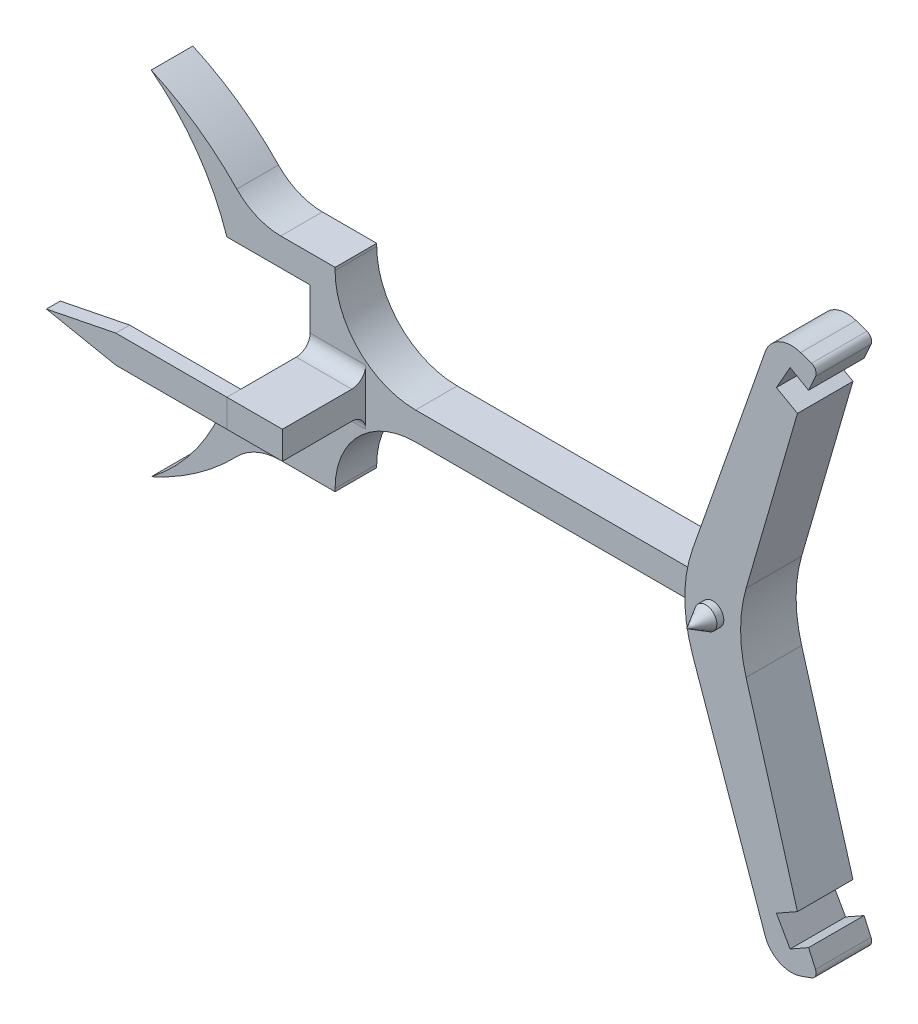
ISO-10303-21;
HEADER;
FILE_DESCRIPTION(('STEP AP214'),'2;1');
FILE_NAME('part.step','',(''),(''),'','','');
FILE_SCHEMA(('AUTOMOTIVE_DESIGN { 1 0 10303 214 1 1 1 1 }'));
ENDSEC;
DATA;
#1=APPLICATION_CONTEXT('core data for automotive mechanical design processes');
#2=APPLICATION_PROTOCOL_DEFINITION('international standard','automotive_design',2000,#1);
#3=PRODUCT_CONTEXT('',#1,'mechanical');
#4=PRODUCT('Part','Part','',(#3));
#5=PRODUCT_RELATED_PRODUCT_CATEGORY('part','',(#4));
#6=PRODUCT_DEFINITION_FORMATION('','',#4);
#7=PRODUCT_DEFINITION_CONTEXT('part definition',#1,'design');
#8=PRODUCT_DEFINITION('design','',#6,#7);
#9=PRODUCT_DEFINITION_SHAPE('','',#8);
#10=(LENGTH_UNIT() NAMED_UNIT(*) SI_UNIT(.MILLI.,.METRE.));
#11=(NAMED_UNIT(*) PLANE_ANGLE_UNIT() SI_UNIT($,.RADIAN.));
#12=(NAMED_UNIT(*) SI_UNIT($,.STERADIAN.) SOLID_ANGLE_UNIT());
#13=UNCERTAINTY_MEASURE_WITH_UNIT(LENGTH_MEASURE(1.E-05),#10,'distance_accuracy_value','');
#14=(GEOMETRIC_REPRESENTATION_CONTEXT(3) GLOBAL_UNCERTAINTY_ASSIGNED_CONTEXT((#13)) GLOBAL_UNIT_ASSIGNED_CONTEXT((#10,
#11,#12)) REPRESENTATION_CONTEXT('',''));
#15=CARTESIAN_POINT('',(0.,0.,0.));
#16=DIRECTION('',(0.,0.,1.));
#17=DIRECTION('',(1.,0.,0.));
#18=AXIS2_PLACEMENT_3D('',#15,#16,#17);
#19=CARTESIAN_POINT('',(-0.924695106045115,-4.62347553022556,4.5));
#20=DIRECTION('',(-0.196116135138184,-0.98058067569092,0.));
#21=DIRECTION('',(0.98058067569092,-0.196116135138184,0.));
#22=AXIS2_PLACEMENT_3D('',#19,#20,#21);
#23=PLANE('',#22);
#24=DIRECTION('',(-0.98058067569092,0.196116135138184,0.));
#25=VECTOR('',#24,1.);
#26=CARTESIAN_POINT('',(-0.924695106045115,-4.62347553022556,4.));
#27=LINE('',#26,#25);
#28=CARTESIAN_POINT('',(-21.5420727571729,-0.500000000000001,4.));
#29=VERTEX_POINT('',#28);
#30=CARTESIAN_POINT('',(-24.0420727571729,0.,4.));
#31=VERTEX_POINT('',#30);
#32=EDGE_CURVE('E183',#29,#31,#27,.T.);
#33=ORIENTED_EDGE('',*,*,#32,.F.);
#34=DIRECTION('',(0.,0.,-1.));
#35=VECTOR('',#34,1.);
#36=CARTESIAN_POINT('',(-21.5420727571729,-0.500000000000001,4.5));
#37=LINE('',#36,#35);
#38=CARTESIAN_POINT('',(-21.5420727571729,-0.500000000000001,4.5));
#39=VERTEX_POINT('',#38);
#40=EDGE_CURVE('E13',#39,#29,#37,.T.);
#41=ORIENTED_EDGE('',*,*,#40,.F.);
#42=DIRECTION('',(-0.98058067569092,0.196116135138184,0.));
#43=VECTOR('',#42,1.);
#44=CARTESIAN_POINT('',(-0.924695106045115,-4.62347553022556,4.5));
#45=LINE('',#44,#43);
#46=CARTESIAN_POINT('',(-24.0420727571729,0.,4.5));
#47=VERTEX_POINT('',#46);
#48=EDGE_CURVE('E178',#39,#47,#45,.T.);
#49=ORIENTED_EDGE('',*,*,#48,.T.);
#50=DIRECTION('',(0.,0.,-1.));
#51=VECTOR('',#50,1.);
#52=CARTESIAN_POINT('',(-24.0420727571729,0.,4.5));
#53=LINE('',#52,#51);
#54=EDGE_CURVE('E150',#47,#31,#53,.T.);
#55=ORIENTED_EDGE('',*,*,#54,.T.);
#56=EDGE_LOOP('',(#33,#41,#49,#55));
#57=FACE_BOUND('',#56,.T.);
#58=ADVANCED_FACE('F109',(#57),#23,.T.);
#59=CARTESIAN_POINT('',(0.,-0.500000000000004,4.5));
#60=DIRECTION('',(0.,-1.,0.));
#61=DIRECTION('',(1.,0.,0.));
#62=AXIS2_PLACEMENT_3D('',#59,#60,#61);
#63=PLANE('',#62);
#64=DIRECTION('',(-1.,0.,0.));
#65=VECTOR('',#64,1.);
#66=CARTESIAN_POINT('',(0.,-0.500000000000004,4.));
#67=LINE('',#66,#65);
#68=CARTESIAN_POINT('',(-17.5420727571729,-0.500000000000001,4.));
#69=VERTEX_POINT('',#68);
#70=EDGE_CURVE('E186',#69,#29,#67,.T.);
#71=ORIENTED_EDGE('',*,*,#70,.F.);
#72=DIRECTION('',(0.,0.,-1.));
#73=VECTOR('',#72,1.);
#74=CARTESIAN_POINT('',(-17.5420727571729,-0.500000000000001,4.5));
#75=LINE('',#74,#73);
#76=CARTESIAN_POINT('',(-17.5420727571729,-0.500000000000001,4.5));
#77=VERTEX_POINT('',#76);
#78=EDGE_CURVE('E117',#77,#69,#75,.T.);
#79=ORIENTED_EDGE('',*,*,#78,.F.);
#80=DIRECTION('',(-1.,0.,0.));
#81=VECTOR('',#80,1.);
#82=CARTESIAN_POINT('',(0.,-0.500000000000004,4.5));
#83=LINE('',#82,#81);
#84=EDGE_CURVE('E176',#77,#39,#83,.T.);
#85=ORIENTED_EDGE('',*,*,#84,.T.);
#86=ORIENTED_EDGE('',*,*,#40,.T.);
#87=EDGE_LOOP('',(#71,#79,#85,#86));
#88=FACE_BOUND('',#87,.T.);
#89=ADVANCED_FACE('F196',(#88),#63,.T.);
#90=CARTESIAN_POINT('',(-17.5420727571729,0.,4.5));
#91=DIRECTION('',(1.,0.,0.));
#92=DIRECTION('',(0.,0.,-1.));
#93=AXIS2_PLACEMENT_3D('',#90,#91,#92);
#94=PLANE('',#93);
#95=DIRECTION('',(0.,-1.,0.));
#96=VECTOR('',#95,1.);
#97=CARTESIAN_POINT('',(-17.5420727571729,0.,4.));
#98=LINE('',#97,#96);
#99=CARTESIAN_POINT('',(-17.5420727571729,0.5,4.));
#100=VERTEX_POINT('',#99);
#101=EDGE_CURVE('E167',#100,#69,#98,.T.);
#102=ORIENTED_EDGE('',*,*,#101,.F.);
#103=DIRECTION('',(0.,0.,-1.));
#104=VECTOR('',#103,1.);
#105=CARTESIAN_POINT('',(-17.5420727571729,0.5,4.5));
#106=LINE('',#105,#104);
#107=CARTESIAN_POINT('',(-17.5420727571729,0.5,4.5));
#108=VERTEX_POINT('',#107);
#109=EDGE_CURVE('E161',#108,#100,#106,.T.);
#110=ORIENTED_EDGE('',*,*,#109,.F.);
#111=DIRECTION('',(0.,-1.,0.));
#112=VECTOR('',#111,1.);
#113=CARTESIAN_POINT('',(-17.5420727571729,0.,4.5));
#114=LINE('',#113,#112);
#115=EDGE_CURVE('E165',#108,#77,#114,.T.);
#116=ORIENTED_EDGE('',*,*,#115,.T.);
#117=ORIENTED_EDGE('',*,*,#78,.T.);
#118=EDGE_LOOP('',(#102,#110,#116,#117));
#119=FACE_BOUND('',#118,.T.);
#120=ADVANCED_FACE('F163',(#119),#94,.T.);
#121=CARTESIAN_POINT('',(0.,0.500000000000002,4.5));
#122=DIRECTION('',(0.,-1.,0.));
#123=DIRECTION('',(1.,0.,0.));
#124=AXIS2_PLACEMENT_3D('',#121,#122,#123);
#125=PLANE('',#124);
#126=DIRECTION('',(-1.,0.,0.));
#127=VECTOR('',#126,1.);
#128=CARTESIAN_POINT('',(0.,0.500000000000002,4.));
#129=LINE('',#128,#127);
#130=CARTESIAN_POINT('',(-21.5420727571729,0.5,4.));
#131=VERTEX_POINT('',#130);
#132=EDGE_CURVE('E143',#100,#131,#129,.T.);
#133=ORIENTED_EDGE('',*,*,#132,.T.);
#134=DIRECTION('',(0.,0.,-1.));
#135=VECTOR('',#134,1.);
#136=CARTESIAN_POINT('',(-21.5420727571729,0.5,4.5));
#137=LINE('',#136,#135);
#138=CARTESIAN_POINT('',(-21.5420727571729,0.5,4.5));
#139=VERTEX_POINT('',#138);
#140=EDGE_CURVE('E168',#139,#131,#137,.T.);
#141=ORIENTED_EDGE('',*,*,#140,.F.);
#142=DIRECTION('',(-1.,0.,0.));
#143=VECTOR('',#142,1.);
#144=CARTESIAN_POINT('',(0.,0.500000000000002,4.5));
#145=LINE('',#144,#143);
#146=EDGE_CURVE('E170',#108,#139,#145,.T.);
#147=ORIENTED_EDGE('',*,*,#146,.F.);
#148=ORIENTED_EDGE('',*,*,#109,.T.);
#149=EDGE_LOOP('',(#133,#141,#147,#148));
#150=FACE_BOUND('',#149,.T.);
#151=ADVANCED_FACE('F171',(#150),#125,.F.);
#152=CARTESIAN_POINT('',(-0.92469510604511,4.62347553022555,4.5));
#153=DIRECTION('',(0.196116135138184,-0.98058067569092,0.));
#154=DIRECTION('',(0.98058067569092,0.196116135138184,0.));
#155=AXIS2_PLACEMENT_3D('',#152,#153,#154);
#156=PLANE('',#155);
#157=DIRECTION('',(-0.98058067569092,-0.196116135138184,0.));
#158=VECTOR('',#157,1.);
#159=CARTESIAN_POINT('',(-0.92469510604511,4.62347553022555,4.));
#160=LINE('',#159,#158);
#161=EDGE_CURVE('E191',#131,#31,#160,.T.);
#162=ORIENTED_EDGE('',*,*,#161,.T.);
#163=ORIENTED_EDGE('',*,*,#54,.F.);
#164=DIRECTION('',(-0.98058067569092,-0.196116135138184,0.));
#165=VECTOR('',#164,1.);
#166=CARTESIAN_POINT('',(-0.92469510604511,4.62347553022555,4.5));
#167=LINE('',#166,#165);
#168=EDGE_CURVE('E125',#139,#47,#167,.T.);
#169=ORIENTED_EDGE('',*,*,#168,.F.);
#170=ORIENTED_EDGE('',*,*,#140,.T.);
#171=EDGE_LOOP('',(#162,#163,#169,#170));
#172=FACE_BOUND('',#171,.T.);
#173=ADVANCED_FACE('F201',(#172),#156,.F.);
#174=CARTESIAN_POINT('',(0.,0.,4.5));
#175=DIRECTION('',(0.,0.,1.));
#176=DIRECTION('',(1.,0.,0.));
#177=AXIS2_PLACEMENT_3D('',#174,#175,#176);
#178=PLANE('',#177);
#179=ORIENTED_EDGE('',*,*,#48,.F.);
#180=ORIENTED_EDGE('',*,*,#84,.F.);
#181=ORIENTED_EDGE('',*,*,#115,.F.);
#182=ORIENTED_EDGE('',*,*,#146,.T.);
#183=ORIENTED_EDGE('',*,*,#168,.T.);
#184=EDGE_LOOP('',(#179,#180,#181,#182,#183));
#185=FACE_BOUND('',#184,.T.);
#186=ADVANCED_FACE('F174',(#185),#178,.T.);
#187=CARTESIAN_POINT('',(0.,0.,4.));
#188=DIRECTION('',(0.,0.,1.));
#189=DIRECTION('',(1.,0.,0.));
#190=AXIS2_PLACEMENT_3D('',#187,#188,#189);
#191=PLANE('',#190);
#192=ORIENTED_EDGE('',*,*,#32,.T.);
#193=ORIENTED_EDGE('',*,*,#161,.F.);
#194=ORIENTED_EDGE('',*,*,#132,.F.);
#195=ORIENTED_EDGE('',*,*,#101,.T.);
#196=ORIENTED_EDGE('',*,*,#70,.T.);
#197=EDGE_LOOP('',(#192,#193,#194,#195,#196));
#198=FACE_BOUND('',#197,.T.);
#199=ADVANCED_FACE('F198',(#198),#191,.F.);
#200=CLOSED_SHELL('',(#58,#89,#120,#151,#173,#186,#199));
#201=MANIFOLD_SOLID_BREP('B2',#200);
#202=CARTESIAN_POINT('',(-13.7434070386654,-3.4,1.5));
#203=DIRECTION('',(0.,0.,1.));
#204=DIRECTION('',(1.,0.,0.));
#205=AXIS2_PLACEMENT_3D('',#202,#203,#204);
#206=PLANE('',#205);
#207=DIRECTION('',(0.,1.,0.));
#208=VECTOR('',#207,1.);
#209=CARTESIAN_POINT('',(-17.5420727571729,-2.5,1.5));
#210=LINE('',#209,#208);
#211=CARTESIAN_POINT('',(-17.5420727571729,1.,1.5));
#212=VERTEX_POINT('',#211);
#213=CARTESIAN_POINT('',(-17.5420727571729,2.5,1.5));
#214=VERTEX_POINT('',#213);
#215=EDGE_CURVE('E610',#212,#214,#210,.T.);
#216=ORIENTED_EDGE('',*,*,#215,.F.);
#217=DIRECTION('',(1.,0.,0.));
#218=VECTOR('',#217,1.);
#219=CARTESIAN_POINT('',(-15.5420727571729,1.,1.5));
#220=LINE('',#219,#218);
#221=CARTESIAN_POINT('',(-15.5420727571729,1.,1.5));
#222=VERTEX_POINT('',#221);
#223=EDGE_CURVE('E885',#212,#222,#220,.T.);
#224=ORIENTED_EDGE('',*,*,#223,.T.);
#225=DIRECTION('',(0.,-1.,0.));
#226=VECTOR('',#225,1.);
#227=CARTESIAN_POINT('',(-15.5420727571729,0.,1.5));
#228=LINE('',#227,#226);
#229=CARTESIAN_POINT('',(-15.5420727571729,-1.,1.5));
#230=VERTEX_POINT('',#229);
#231=EDGE_CURVE('E564',#222,#230,#228,.T.);
#232=ORIENTED_EDGE('',*,*,#231,.T.);
#233=DIRECTION('',(1.,0.,0.));
#234=VECTOR('',#233,1.);
#235=CARTESIAN_POINT('',(-13.7434070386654,-0.999999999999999,1.5));
#236=LINE('',#235,#234);
#237=CARTESIAN_POINT('',(-17.5420727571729,-1.,1.5));
#238=VERTEX_POINT('',#237);
#239=EDGE_CURVE('E841',#230,#238,#236,.F.);
#240=ORIENTED_EDGE('',*,*,#239,.T.);
#241=CARTESIAN_POINT('',(-17.5420727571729,-2.5,1.5));
#242=VERTEX_POINT('',#241);
#243=EDGE_CURVE('E611',#242,#238,#210,.T.);
#244=ORIENTED_EDGE('',*,*,#243,.F.);
#245=DIRECTION('',(1.,0.,0.));
#246=VECTOR('',#245,1.);
#247=CARTESIAN_POINT('',(-20.5420727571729,-2.5,1.5));
#248=LINE('',#247,#246);
#249=CARTESIAN_POINT('',(-20.5420727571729,-2.5,1.5));
#250=VERTEX_POINT('',#249);
#251=EDGE_CURVE('E607',#250,#242,#248,.T.);
#252=ORIENTED_EDGE('',*,*,#251,.F.);
#253=CARTESIAN_POINT('',(-28.1414148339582,0.,1.5));
#254=DIRECTION('',(0.,0.,-1.));
#255=DIRECTION('',(-1.,0.,0.));
#256=AXIS2_PLACEMENT_3D('',#253,#254,#255);
#257=CIRCLE('',#256,8.);
#258=CARTESIAN_POINT('',(-23.2661774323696,-6.34287476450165,1.5));
#259=VERTEX_POINT('',#258);
#260=EDGE_CURVE('E605',#250,#259,#257,.T.);
#261=ORIENTED_EDGE('',*,*,#260,.T.);
#262=CARTESIAN_POINT('',(-27.3775278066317,2.77286975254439,1.5));
#263=DIRECTION('',(0.,0.,1.));
#264=DIRECTION('',(1.,0.,0.));
#265=AXIS2_PLACEMENT_3D('',#262,#263,#264);
#266=CIRCLE('',#265,10.);
#267=CARTESIAN_POINT('',(-20.1825768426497,-4.17210545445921,1.5));
#268=VERTEX_POINT('',#267);
#269=EDGE_CURVE('E603',#259,#268,#266,.T.);
#270=ORIENTED_EDGE('',*,*,#269,.T.);
#271=CARTESIAN_POINT('',(-18.5996876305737,-5.7,1.5));
#272=DIRECTION('',(0.,0.,1.));
#273=DIRECTION('',(1.,0.,0.));
#274=AXIS2_PLACEMENT_3D('',#271,#272,#273);
#275=CIRCLE('',#274,2.2);
#276=CARTESIAN_POINT('',(-18.5996876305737,-3.5,1.5));
#277=VERTEX_POINT('',#276);
#278=EDGE_CURVE('E600',#277,#268,#275,.T.);
#279=ORIENTED_EDGE('',*,*,#278,.F.);
#280=DIRECTION('',(1.,0.,0.));
#281=VECTOR('',#280,1.);
#282=CARTESIAN_POINT('',(-17.5420727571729,-3.5,1.5));
#283=LINE('',#282,#281);
#284=CARTESIAN_POINT('',(-16.6434070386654,-3.5,1.5));
#285=VERTEX_POINT('',#284);
#286=EDGE_CURVE('E598',#277,#285,#283,.T.);
#287=ORIENTED_EDGE('',*,*,#286,.T.);
#288=DIRECTION('',(0.,1.,0.));
#289=VECTOR('',#288,1.);
#290=CARTESIAN_POINT('',(-16.6434070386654,-3.5,1.5));
#291=LINE('',#290,#289);
#292=CARTESIAN_POINT('',(-16.6434070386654,-3.40000000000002,1.5));
#293=VERTEX_POINT('',#292);
#294=EDGE_CURVE('E596',#285,#293,#291,.T.);
#295=ORIENTED_EDGE('',*,*,#294,.T.);
#296=CARTESIAN_POINT('',(-13.7434070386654,-3.4,1.5));
#297=DIRECTION('',(0.,0.,1.));
#298=DIRECTION('',(1.,0.,0.));
#299=AXIS2_PLACEMENT_3D('',#296,#297,#298);
#300=CIRCLE('',#299,2.9);
#301=CARTESIAN_POINT('',(-13.7434070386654,-0.5,1.5));
#302=VERTEX_POINT('',#301);
#303=EDGE_CURVE('E592',#302,#293,#300,.T.);
#304=ORIENTED_EDGE('',*,*,#303,.F.);
#305=DIRECTION('',(-1.,0.,0.));
#306=VECTOR('',#305,1.);
#307=CARTESIAN_POINT('',(-3.52197075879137,-0.5,1.5));
#308=LINE('',#307,#306);
#309=CARTESIAN_POINT('',(-3.52197075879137,-0.499999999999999,1.5));
#310=VERTEX_POINT('',#309);
#311=EDGE_CURVE('E589',#310,#302,#308,.T.);
#312=ORIENTED_EDGE('',*,*,#311,.F.);
#313=CARTESIAN_POINT('',(1.45296642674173,0.,1.5));
#314=DIRECTION('',(0.,0.,1.));
#315=DIRECTION('',(1.,0.,0.));
#316=AXIS2_PLACEMENT_3D('',#313,#314,#315);
#317=CIRCLE('',#316,5.);
#318=CARTESIAN_POINT('',(-3.52197075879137,0.5,1.5));
#319=VERTEX_POINT('',#318);
#320=EDGE_CURVE('E633',#319,#310,#317,.T.);
#321=ORIENTED_EDGE('',*,*,#320,.F.);
#322=DIRECTION('',(-1.,0.,0.));
#323=VECTOR('',#322,1.);
#324=CARTESIAN_POINT('',(-3.52197075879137,0.5,1.5));
#325=LINE('',#324,#323);
#326=CARTESIAN_POINT('',(-13.7434070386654,0.499999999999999,1.5));
#327=VERTEX_POINT('',#326);
#328=EDGE_CURVE('E631',#319,#327,#325,.T.);
#329=ORIENTED_EDGE('',*,*,#328,.T.);
#330=CARTESIAN_POINT('',(-13.7434070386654,3.4,1.5));
#331=DIRECTION('',(0.,0.,-1.));
#332=DIRECTION('',(-1.,0.,0.));
#333=AXIS2_PLACEMENT_3D('',#330,#331,#332);
#334=CIRCLE('',#333,2.9);
#335=CARTESIAN_POINT('',(-16.6434070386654,3.40000000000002,1.5));
#336=VERTEX_POINT('',#335);
#337=EDGE_CURVE('E629',#327,#336,#334,.T.);
#338=ORIENTED_EDGE('',*,*,#337,.T.);
#339=DIRECTION('',(0.,-1.,0.));
#340=VECTOR('',#339,1.);
#341=CARTESIAN_POINT('',(-16.6434070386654,3.5,1.5));
#342=LINE('',#341,#340);
#343=CARTESIAN_POINT('',(-16.6434070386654,3.5,1.5));
#344=VERTEX_POINT('',#343);
#345=EDGE_CURVE('E626',#344,#336,#342,.T.);
#346=ORIENTED_EDGE('',*,*,#345,.F.);
#347=DIRECTION('',(1.,0.,0.));
#348=VECTOR('',#347,1.);
#349=CARTESIAN_POINT('',(-18.5996876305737,3.5,1.5));
#350=LINE('',#349,#348);
#351=CARTESIAN_POINT('',(-18.5996876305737,3.5,1.5));
#352=VERTEX_POINT('',#351);
#353=EDGE_CURVE('E624',#352,#344,#350,.T.);
#354=ORIENTED_EDGE('',*,*,#353,.F.);
#355=CARTESIAN_POINT('',(-18.5996876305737,5.7,1.5));
#356=DIRECTION('',(0.,0.,-1.));
#357=DIRECTION('',(-1.,0.,0.));
#358=AXIS2_PLACEMENT_3D('',#355,#356,#357);
#359=CIRCLE('',#358,2.2);
#360=CARTESIAN_POINT('',(-20.1825768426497,4.17210545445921,1.5));
#361=VERTEX_POINT('',#360);
#362=EDGE_CURVE('E622',#352,#361,#359,.T.);
#363=ORIENTED_EDGE('',*,*,#362,.T.);
#364=CARTESIAN_POINT('',(-27.3775278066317,-2.7728697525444,1.5));
#365=DIRECTION('',(0.,0.,-1.));
#366=DIRECTION('',(-1.,0.,0.));
#367=AXIS2_PLACEMENT_3D('',#364,#365,#366);
#368=CIRCLE('',#367,10.);
#369=CARTESIAN_POINT('',(-23.2661774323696,6.34287476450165,1.5));
#370=VERTEX_POINT('',#369);
#371=EDGE_CURVE('E619',#370,#361,#368,.T.);
#372=ORIENTED_EDGE('',*,*,#371,.F.);
#373=CARTESIAN_POINT('',(-28.1414148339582,0.,1.5));
#374=DIRECTION('',(0.,0.,1.));
#375=DIRECTION('',(1.,0.,0.));
#376=AXIS2_PLACEMENT_3D('',#373,#374,#375);
#377=CIRCLE('',#376,8.);
#378=CARTESIAN_POINT('',(-20.5420727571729,2.5,1.5));
#379=VERTEX_POINT('',#378);
#380=EDGE_CURVE('E616',#379,#370,#377,.T.);
#381=ORIENTED_EDGE('',*,*,#380,.F.);
#382=DIRECTION('',(1.,0.,0.));
#383=VECTOR('',#382,1.);
#384=CARTESIAN_POINT('',(-20.5420727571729,2.5,1.5));
#385=LINE('',#384,#383);
#386=EDGE_CURVE('E613',#379,#214,#385,.T.);
#387=ORIENTED_EDGE('',*,*,#386,.T.);
#388=EDGE_LOOP('',(#216,#224,#232,#240,#244,#252,#261,#270,#279,#287,#295,#304,#312,#321,#329,
#338,#346,#354,#363,#372,#381,#387));
#389=FACE_BOUND('',#388,.T.);
#390=ADVANCED_FACE('F261',(#389),#206,.T.);
#391=CARTESIAN_POINT('',(1.45296642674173,0.,2.));
#392=DIRECTION('',(0.,0.,-1.));
#393=DIRECTION('',(-1.,0.,0.));
#394=AXIS2_PLACEMENT_3D('',#391,#392,#393);
#395=PLANE('',#394);
#396=CARTESIAN_POINT('',(1.45296642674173,0.,2.));
#397=DIRECTION('',(0.,0.,-1.));
#398=DIRECTION('',(-1.,0.,0.));
#399=AXIS2_PLACEMENT_3D('',#396,#397,#398);
#400=CIRCLE('',#399,5.);
#401=CARTESIAN_POINT('',(-3.26548898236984,-1.65413982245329,2.));
#402=VERTEX_POINT('',#401);
#403=CARTESIAN_POINT('',(-3.26548898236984,1.65413982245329,2.));
#404=VERTEX_POINT('',#403);
#405=EDGE_CURVE('E729',#402,#404,#400,.T.);
#406=ORIENTED_EDGE('',*,*,#405,.F.);
#407=DIRECTION('',(0.330827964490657,-0.943691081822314,0.));
#408=VECTOR('',#407,1.);
#409=CARTESIAN_POINT('',(-3.26548898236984,-1.65413982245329,2.));
#410=LINE('',#409,#408);
#411=CARTESIAN_POINT('',(-0.651242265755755,-9.11131266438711,2.));
#412=VERTEX_POINT('',#411);
#413=EDGE_CURVE('E781',#402,#412,#410,.T.);
#414=ORIENTED_EDGE('',*,*,#413,.T.);
#415=CARTESIAN_POINT('',(0.292448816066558,-8.78048469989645,2.));
#416=DIRECTION('',(0.,0.,-1.));
#417=DIRECTION('',(-1.,0.,0.));
#418=AXIS2_PLACEMENT_3D('',#415,#416,#417);
#419=CIRCLE('',#418,1.);
#420=CARTESIAN_POINT('',(0.623276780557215,-9.72417578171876,2.));
#421=VERTEX_POINT('',#420);
#422=EDGE_CURVE('E778',#421,#412,#419,.T.);
#423=ORIENTED_EDGE('',*,*,#422,.F.);
#424=DIRECTION('',(0.943691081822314,0.330827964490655,0.));
#425=VECTOR('',#424,1.);
#426=CARTESIAN_POINT('',(0.623276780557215,-9.72417578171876,2.));
#427=LINE('',#426,#425);
#428=CARTESIAN_POINT('',(1.01488921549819,-9.58688896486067,2.));
#429=VERTEX_POINT('',#428);
#430=EDGE_CURVE('E776',#421,#429,#427,.T.);
#431=ORIENTED_EDGE('',*,*,#430,.T.);
#432=CARTESIAN_POINT('',(0.93218222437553,-9.35096619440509,2.));
#433=DIRECTION('',(0.,0.,-1.));
#434=DIRECTION('',(-1.,0.,0.));
#435=AXIS2_PLACEMENT_3D('',#432,#433,#434);
#436=CIRCLE('',#435,0.250000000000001);
#437=CARTESIAN_POINT('',(1.16035861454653,-9.24881172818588,2.));
#438=VERTEX_POINT('',#437);
#439=EDGE_CURVE('E773',#438,#429,#436,.T.);
#440=ORIENTED_EDGE('',*,*,#439,.F.);
#441=DIRECTION('',(-0.408617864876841,0.912705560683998,0.));
#442=VECTOR('',#441,1.);
#443=CARTESIAN_POINT('',(1.16035861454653,-9.24881172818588,2.));
#444=LINE('',#443,#442);
#445=CARTESIAN_POINT('',(0.911345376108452,-8.69260558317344,2.));
#446=VERTEX_POINT('',#445);
#447=EDGE_CURVE('E771',#438,#446,#444,.T.);
#448=ORIENTED_EDGE('',*,*,#447,.T.);
#449=DIRECTION('',(-0.870447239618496,-0.492261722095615,0.));
#450=VECTOR('',#449,1.);
#451=CARTESIAN_POINT('',(0.911345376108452,-8.69260558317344,2.));
#452=LINE('',#451,#450);
#453=CARTESIAN_POINT('',(0.246130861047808,-9.06880258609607,2.));
#454=VERTEX_POINT('',#453);
#455=EDGE_CURVE('E769',#446,#454,#452,.T.);
#456=ORIENTED_EDGE('',*,*,#455,.T.);
#457=DIRECTION('',(-0.49226172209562,0.870447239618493,0.));
#458=VECTOR('',#457,1.);
#459=CARTESIAN_POINT('',(0.246130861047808,-9.06880258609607,2.));
#460=LINE('',#459,#458);
#461=CARTESIAN_POINT('',(-0.246130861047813,-8.19835534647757,2.));
#462=VERTEX_POINT('',#461);
#463=EDGE_CURVE('E767',#454,#462,#460,.T.);
#464=ORIENTED_EDGE('',*,*,#463,.T.);
#465=DIRECTION('',(0.870447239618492,0.492261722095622,0.));
#466=VECTOR('',#465,1.);
#467=CARTESIAN_POINT('',(-0.246130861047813,-8.19835534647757,2.));
#468=LINE('',#467,#466);
#469=CARTESIAN_POINT('',(0.510365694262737,-7.77053585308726,2.));
#470=VERTEX_POINT('',#469);
#471=EDGE_CURVE('E765',#462,#470,#468,.T.);
#472=ORIENTED_EDGE('',*,*,#471,.T.);
#473=DIRECTION('',(-0.278528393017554,0.960427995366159,0.));
#474=VECTOR('',#473,1.);
#475=CARTESIAN_POINT('',(0.510365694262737,-7.77053585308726,2.));
#476=LINE('',#475,#474);
#477=CARTESIAN_POINT('',(-1.3392519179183,-1.39264196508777,2.));
#478=VERTEX_POINT('',#477);
#479=EDGE_CURVE('E763',#470,#478,#476,.T.);
#480=ORIENTED_EDGE('',*,*,#479,.T.);
#481=CARTESIAN_POINT('',(3.4628880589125,0.,2.));
#482=DIRECTION('',(0.,0.,1.));
#483=DIRECTION('',(1.,0.,0.));
#484=AXIS2_PLACEMENT_3D('',#481,#482,#483);
#485=CIRCLE('',#484,5.);
#486=CARTESIAN_POINT('',(-1.3392519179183,1.39264196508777,2.));
#487=VERTEX_POINT('',#486);
#488=EDGE_CURVE('E760',#487,#478,#485,.T.);
#489=ORIENTED_EDGE('',*,*,#488,.F.);
#490=DIRECTION('',(-0.278528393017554,-0.960427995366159,0.));
#491=VECTOR('',#490,1.);
#492=CARTESIAN_POINT('',(0.510365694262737,7.77053585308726,2.));
#493=LINE('',#492,#491);
#494=CARTESIAN_POINT('',(0.510365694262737,7.77053585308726,2.));
#495=VERTEX_POINT('',#494);
#496=EDGE_CURVE('E757',#495,#487,#493,.T.);
#497=ORIENTED_EDGE('',*,*,#496,.F.);
#498=DIRECTION('',(0.870447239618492,-0.492261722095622,0.));
#499=VECTOR('',#498,1.);
#500=CARTESIAN_POINT('',(-0.246130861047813,8.19835534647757,2.));
#501=LINE('',#500,#499);
#502=CARTESIAN_POINT('',(-0.246130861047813,8.19835534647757,2.));
#503=VERTEX_POINT('',#502);
#504=EDGE_CURVE('E754',#503,#495,#501,.T.);
#505=ORIENTED_EDGE('',*,*,#504,.F.);
#506=DIRECTION('',(-0.49226172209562,-0.870447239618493,0.));
#507=VECTOR('',#506,1.);
#508=CARTESIAN_POINT('',(0.246130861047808,9.06880258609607,2.));
#509=LINE('',#508,#507);
#510=CARTESIAN_POINT('',(0.246130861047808,9.06880258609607,2.));
#511=VERTEX_POINT('',#510);
#512=EDGE_CURVE('E751',#511,#503,#509,.T.);
#513=ORIENTED_EDGE('',*,*,#512,.F.);
#514=DIRECTION('',(-0.870447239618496,0.492261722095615,0.));
#515=VECTOR('',#514,1.);
#516=CARTESIAN_POINT('',(0.911345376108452,8.69260558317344,2.));
#517=LINE('',#516,#515);
#518=CARTESIAN_POINT('',(0.911345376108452,8.69260558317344,2.));
#519=VERTEX_POINT('',#518);
#520=EDGE_CURVE('E748',#519,#511,#517,.T.);
#521=ORIENTED_EDGE('',*,*,#520,.F.);
#522=DIRECTION('',(-0.408617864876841,-0.912705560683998,0.));
#523=VECTOR('',#522,1.);
#524=CARTESIAN_POINT('',(1.16035861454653,9.24881172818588,2.));
#525=LINE('',#524,#523);
#526=CARTESIAN_POINT('',(1.16035861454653,9.24881172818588,2.));
#527=VERTEX_POINT('',#526);
#528=EDGE_CURVE('E745',#527,#519,#525,.T.);
#529=ORIENTED_EDGE('',*,*,#528,.F.);
#530=CARTESIAN_POINT('',(0.93218222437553,9.35096619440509,2.));
#531=DIRECTION('',(0.,0.,-1.));
#532=DIRECTION('',(-1.,0.,0.));
#533=AXIS2_PLACEMENT_3D('',#530,#531,#532);
#534=CIRCLE('',#533,0.250000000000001);
#535=CARTESIAN_POINT('',(1.01488921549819,9.58688896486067,2.));
#536=VERTEX_POINT('',#535);
#537=EDGE_CURVE('E742',#536,#527,#534,.T.);
#538=ORIENTED_EDGE('',*,*,#537,.F.);
#539=DIRECTION('',(0.943691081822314,-0.330827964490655,0.));
#540=VECTOR('',#539,1.);
#541=CARTESIAN_POINT('',(0.623276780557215,9.72417578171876,2.));
#542=LINE('',#541,#540);
#543=CARTESIAN_POINT('',(0.623276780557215,9.72417578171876,2.));
#544=VERTEX_POINT('',#543);
#545=EDGE_CURVE('E739',#544,#536,#542,.T.);
#546=ORIENTED_EDGE('',*,*,#545,.F.);
#547=CARTESIAN_POINT('',(0.292448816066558,8.78048469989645,2.));
#548=DIRECTION('',(0.,0.,-1.));
#549=DIRECTION('',(-1.,0.,0.));
#550=AXIS2_PLACEMENT_3D('',#547,#548,#549);
#551=CIRCLE('',#550,1.);
#552=CARTESIAN_POINT('',(-0.651242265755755,9.11131266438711,2.));
#553=VERTEX_POINT('',#552);
#554=EDGE_CURVE('E736',#553,#544,#551,.T.);
#555=ORIENTED_EDGE('',*,*,#554,.F.);
#556=DIRECTION('',(0.330827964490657,0.943691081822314,0.));
#557=VECTOR('',#556,1.);
#558=CARTESIAN_POINT('',(-3.26548898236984,1.65413982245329,2.));
#559=LINE('',#558,#557);
#560=EDGE_CURVE('E732',#404,#553,#559,.T.);
#561=ORIENTED_EDGE('',*,*,#560,.F.);
#562=EDGE_LOOP('',(#406,#414,#423,#431,#440,#448,#456,#464,#472,#480,#489,#497,#505,#513,#521,
#529,#538,#546,#555,#561));
#563=FACE_BOUND('',#562,.T.);
#564=CARTESIAN_POINT('',(-2.54207275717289,0.,2.));
#565=DIRECTION('',(0.,0.,1.));
#566=DIRECTION('',(1.,0.,0.));
#567=AXIS2_PLACEMENT_3D('',#564,#565,#566);
#568=CIRCLE('',#567,0.4);
#569=CARTESIAN_POINT('',(-2.14207275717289,0.,2.));
#570=VERTEX_POINT('',#569);
#571=EDGE_CURVE('E686',#570,#570,#568,.T.);
#572=ORIENTED_EDGE('',*,*,#571,.F.);
#573=EDGE_LOOP('',(#572));
#574=FACE_BOUND('',#573,.T.);
#575=ADVANCED_FACE('F958',(#563,#574),#395,.F.);
#576=CARTESIAN_POINT('',(1.45296642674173,0.,0.));
#577=DIRECTION('',(0.,0.,-1.));
#578=DIRECTION('',(-1.,0.,0.));
#579=AXIS2_PLACEMENT_3D('',#576,#577,#578);
#580=PLANE('',#579);
#581=CARTESIAN_POINT('',(1.45296642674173,0.,0.));
#582=DIRECTION('',(0.,0.,-1.));
#583=DIRECTION('',(-1.,0.,0.));
#584=AXIS2_PLACEMENT_3D('',#581,#582,#583);
#585=CIRCLE('',#584,5.);
#586=CARTESIAN_POINT('',(-3.26548898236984,-1.65413982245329,0.));
#587=VERTEX_POINT('',#586);
#588=CARTESIAN_POINT('',(-3.52197075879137,-0.499999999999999,0.));
#589=VERTEX_POINT('',#588);
#590=EDGE_CURVE('E784',#587,#589,#585,.T.);
#591=ORIENTED_EDGE('',*,*,#590,.T.);
#592=DIRECTION('',(-1.,0.,0.));
#593=VECTOR('',#592,1.);
#594=CARTESIAN_POINT('',(-3.52197075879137,-0.5,0.));
#595=LINE('',#594,#593);
#596=CARTESIAN_POINT('',(-13.7434070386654,-0.5,0.));
#597=VERTEX_POINT('',#596);
#598=EDGE_CURVE('E588',#589,#597,#595,.T.);
#599=ORIENTED_EDGE('',*,*,#598,.T.);
#600=CARTESIAN_POINT('',(-13.7434070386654,-3.4,0.));
#601=DIRECTION('',(0.,0.,1.));
#602=DIRECTION('',(1.,0.,0.));
#603=AXIS2_PLACEMENT_3D('',#600,#601,#602);
#604=CIRCLE('',#603,2.9);
#605=CARTESIAN_POINT('',(-16.6434070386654,-3.40000000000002,0.));
#606=VERTEX_POINT('',#605);
#607=EDGE_CURVE('E639',#597,#606,#604,.T.);
#608=ORIENTED_EDGE('',*,*,#607,.T.);
#609=DIRECTION('',(0.,1.,0.));
#610=VECTOR('',#609,1.);
#611=CARTESIAN_POINT('',(-16.6434070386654,-3.5,0.));
#612=LINE('',#611,#610);
#613=CARTESIAN_POINT('',(-16.6434070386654,-3.5,0.));
#614=VERTEX_POINT('',#613);
#615=EDGE_CURVE('E642',#614,#606,#612,.T.);
#616=ORIENTED_EDGE('',*,*,#615,.F.);
#617=DIRECTION('',(1.,0.,0.));
#618=VECTOR('',#617,1.);
#619=CARTESIAN_POINT('',(-18.5996876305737,-3.5,0.));
#620=LINE('',#619,#618);
#621=CARTESIAN_POINT('',(-18.5996876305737,-3.5,0.));
#622=VERTEX_POINT('',#621);
#623=EDGE_CURVE('E645',#622,#614,#620,.T.);
#624=ORIENTED_EDGE('',*,*,#623,.F.);
#625=CARTESIAN_POINT('',(-18.5996876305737,-5.7,0.));
#626=DIRECTION('',(0.,0.,1.));
#627=DIRECTION('',(1.,0.,0.));
#628=AXIS2_PLACEMENT_3D('',#625,#626,#627);
#629=CIRCLE('',#628,2.2);
#630=CARTESIAN_POINT('',(-20.1825768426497,-4.17210545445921,0.));
#631=VERTEX_POINT('',#630);
#632=EDGE_CURVE('E647',#622,#631,#629,.T.);
#633=ORIENTED_EDGE('',*,*,#632,.T.);
#634=CARTESIAN_POINT('',(-27.3775278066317,2.77286975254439,0.));
#635=DIRECTION('',(0.,0.,1.));
#636=DIRECTION('',(1.,0.,0.));
#637=AXIS2_PLACEMENT_3D('',#634,#635,#636);
#638=CIRCLE('',#637,10.);
#639=CARTESIAN_POINT('',(-23.2661774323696,-6.34287476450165,0.));
#640=VERTEX_POINT('',#639);
#641=EDGE_CURVE('E650',#640,#631,#638,.T.);
#642=ORIENTED_EDGE('',*,*,#641,.F.);
#643=CARTESIAN_POINT('',(-28.1414148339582,0.,0.));
#644=DIRECTION('',(0.,0.,-1.));
#645=DIRECTION('',(-1.,0.,0.));
#646=AXIS2_PLACEMENT_3D('',#643,#644,#645);
#647=CIRCLE('',#646,8.);
#648=CARTESIAN_POINT('',(-20.5420727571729,-2.5,0.));
#649=VERTEX_POINT('',#648);
#650=EDGE_CURVE('E653',#649,#640,#647,.T.);
#651=ORIENTED_EDGE('',*,*,#650,.F.);
#652=DIRECTION('',(1.,0.,0.));
#653=VECTOR('',#652,1.);
#654=CARTESIAN_POINT('',(-20.5420727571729,-2.5,0.));
#655=LINE('',#654,#653);
#656=CARTESIAN_POINT('',(-17.5420727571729,-2.5,0.));
#657=VERTEX_POINT('',#656);
#658=EDGE_CURVE('E655',#649,#657,#655,.T.);
#659=ORIENTED_EDGE('',*,*,#658,.T.);
#660=DIRECTION('',(0.,1.,0.));
#661=VECTOR('',#660,1.);
#662=CARTESIAN_POINT('',(-17.5420727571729,2.4989970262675,0.));
#663=LINE('',#662,#661);
#664=CARTESIAN_POINT('',(-17.5420727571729,2.5,0.));
#665=VERTEX_POINT('',#664);
#666=EDGE_CURVE('E658',#657,#665,#663,.T.);
#667=ORIENTED_EDGE('',*,*,#666,.T.);
#668=DIRECTION('',(1.,0.,0.));
#669=VECTOR('',#668,1.);
#670=CARTESIAN_POINT('',(-20.5420727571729,2.5,0.));
#671=LINE('',#670,#669);
#672=CARTESIAN_POINT('',(-20.5420727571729,2.5,0.));
#673=VERTEX_POINT('',#672);
#674=EDGE_CURVE('E661',#673,#665,#671,.T.);
#675=ORIENTED_EDGE('',*,*,#674,.F.);
#676=CARTESIAN_POINT('',(-28.1414148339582,0.,0.));
#677=DIRECTION('',(0.,0.,1.));
#678=DIRECTION('',(1.,0.,0.));
#679=AXIS2_PLACEMENT_3D('',#676,#677,#678);
#680=CIRCLE('',#679,8.);
#681=CARTESIAN_POINT('',(-23.2661774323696,6.34287476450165,0.));
#682=VERTEX_POINT('',#681);
#683=EDGE_CURVE('E664',#673,#682,#680,.T.);
#684=ORIENTED_EDGE('',*,*,#683,.T.);
#685=CARTESIAN_POINT('',(-27.3775278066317,-2.7728697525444,0.));
#686=DIRECTION('',(0.,0.,-1.));
#687=DIRECTION('',(-1.,0.,0.));
#688=AXIS2_PLACEMENT_3D('',#685,#686,#687);
#689=CIRCLE('',#688,10.);
#690=CARTESIAN_POINT('',(-20.1825768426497,4.17210545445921,0.));
#691=VERTEX_POINT('',#690);
#692=EDGE_CURVE('E667',#682,#691,#689,.T.);
#693=ORIENTED_EDGE('',*,*,#692,.T.);
#694=CARTESIAN_POINT('',(-18.5996876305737,5.7,0.));
#695=DIRECTION('',(0.,0.,-1.));
#696=DIRECTION('',(-1.,0.,0.));
#697=AXIS2_PLACEMENT_3D('',#694,#695,#696);
#698=CIRCLE('',#697,2.2);
#699=CARTESIAN_POINT('',(-18.5996876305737,3.5,0.));
#700=VERTEX_POINT('',#699);
#701=EDGE_CURVE('E670',#700,#691,#698,.T.);
#702=ORIENTED_EDGE('',*,*,#701,.F.);
#703=DIRECTION('',(1.,0.,0.));
#704=VECTOR('',#703,1.);
#705=CARTESIAN_POINT('',(-17.5420727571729,3.5,0.));
#706=LINE('',#705,#704);
#707=CARTESIAN_POINT('',(-16.6434070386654,3.5,0.));
#708=VERTEX_POINT('',#707);
#709=EDGE_CURVE('E673',#700,#708,#706,.T.);
#710=ORIENTED_EDGE('',*,*,#709,.T.);
#711=DIRECTION('',(0.,-1.,0.));
#712=VECTOR('',#711,1.);
#713=CARTESIAN_POINT('',(-16.6434070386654,3.5,0.));
#714=LINE('',#713,#712);
#715=CARTESIAN_POINT('',(-16.6434070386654,3.40000000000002,0.));
#716=VERTEX_POINT('',#715);
#717=EDGE_CURVE('E676',#708,#716,#714,.T.);
#718=ORIENTED_EDGE('',*,*,#717,.T.);
#719=CARTESIAN_POINT('',(-13.7434070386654,3.4,0.));
#720=DIRECTION('',(0.,0.,-1.));
#721=DIRECTION('',(-1.,0.,0.));
#722=AXIS2_PLACEMENT_3D('',#719,#720,#721);
#723=CIRCLE('',#722,2.9);
#724=CARTESIAN_POINT('',(-13.7434070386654,0.499999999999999,0.));
#725=VERTEX_POINT('',#724);
#726=EDGE_CURVE('E679',#725,#716,#723,.T.);
#727=ORIENTED_EDGE('',*,*,#726,.F.);
#728=DIRECTION('',(-1.,0.,0.));
#729=VECTOR('',#728,1.);
#730=CARTESIAN_POINT('',(-3.52197075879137,0.5,0.));
#731=LINE('',#730,#729);
#732=CARTESIAN_POINT('',(-3.52197075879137,0.5,0.));
#733=VERTEX_POINT('',#732);
#734=EDGE_CURVE('E593',#733,#725,#731,.T.);
#735=ORIENTED_EDGE('',*,*,#734,.F.);
#736=CARTESIAN_POINT('',(-3.26548898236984,1.65413982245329,0.));
#737=VERTEX_POINT('',#736);
#738=EDGE_CURVE('E728',#733,#737,#585,.T.);
#739=ORIENTED_EDGE('',*,*,#738,.T.);
#740=DIRECTION('',(0.330827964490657,0.943691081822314,0.));
#741=VECTOR('',#740,1.);
#742=CARTESIAN_POINT('',(-3.26548898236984,1.65413982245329,0.));
#743=LINE('',#742,#741);
#744=CARTESIAN_POINT('',(-0.651242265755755,9.11131266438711,0.));
#745=VERTEX_POINT('',#744);
#746=EDGE_CURVE('E787',#737,#745,#743,.T.);
#747=ORIENTED_EDGE('',*,*,#746,.T.);
#748=CARTESIAN_POINT('',(0.292448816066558,8.78048469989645,0.));
#749=DIRECTION('',(0.,0.,-1.));
#750=DIRECTION('',(-1.,0.,0.));
#751=AXIS2_PLACEMENT_3D('',#748,#749,#750);
#752=CIRCLE('',#751,1.);
#753=CARTESIAN_POINT('',(0.623276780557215,9.72417578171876,0.));
#754=VERTEX_POINT('',#753);
#755=EDGE_CURVE('E790',#745,#754,#752,.T.);
#756=ORIENTED_EDGE('',*,*,#755,.T.);
#757=DIRECTION('',(0.943691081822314,-0.330827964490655,0.));
#758=VECTOR('',#757,1.);
#759=CARTESIAN_POINT('',(0.623276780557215,9.72417578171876,0.));
#760=LINE('',#759,#758);
#761=CARTESIAN_POINT('',(1.01488921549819,9.58688896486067,0.));
#762=VERTEX_POINT('',#761);
#763=EDGE_CURVE('E793',#754,#762,#760,.T.);
#764=ORIENTED_EDGE('',*,*,#763,.T.);
#765=CARTESIAN_POINT('',(0.93218222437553,9.35096619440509,0.));
#766=DIRECTION('',(0.,0.,-1.));
#767=DIRECTION('',(-1.,0.,0.));
#768=AXIS2_PLACEMENT_3D('',#765,#766,#767);
#769=CIRCLE('',#768,0.250000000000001);
#770=CARTESIAN_POINT('',(1.16035861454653,9.24881172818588,0.));
#771=VERTEX_POINT('',#770);
#772=EDGE_CURVE('E796',#762,#771,#769,.T.);
#773=ORIENTED_EDGE('',*,*,#772,.T.);
#774=DIRECTION('',(-0.408617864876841,-0.912705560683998,0.));
#775=VECTOR('',#774,1.);
#776=CARTESIAN_POINT('',(1.16035861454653,9.24881172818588,0.));
#777=LINE('',#776,#775);
#778=CARTESIAN_POINT('',(0.911345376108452,8.69260558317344,0.));
#779=VERTEX_POINT('',#778);
#780=EDGE_CURVE('E799',#771,#779,#777,.T.);
#781=ORIENTED_EDGE('',*,*,#780,.T.);
#782=DIRECTION('',(-0.870447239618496,0.492261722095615,0.));
#783=VECTOR('',#782,1.);
#784=CARTESIAN_POINT('',(0.911345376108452,8.69260558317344,0.));
#785=LINE('',#784,#783);
#786=CARTESIAN_POINT('',(0.246130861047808,9.06880258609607,0.));
#787=VERTEX_POINT('',#786);
#788=EDGE_CURVE('E802',#779,#787,#785,.T.);
#789=ORIENTED_EDGE('',*,*,#788,.T.);
#790=DIRECTION('',(-0.49226172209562,-0.870447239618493,0.));
#791=VECTOR('',#790,1.);
#792=CARTESIAN_POINT('',(0.246130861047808,9.06880258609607,0.));
#793=LINE('',#792,#791);
#794=CARTESIAN_POINT('',(-0.246130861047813,8.19835534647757,0.));
#795=VERTEX_POINT('',#794);
#796=EDGE_CURVE('E805',#787,#795,#793,.T.);
#797=ORIENTED_EDGE('',*,*,#796,.T.);
#798=DIRECTION('',(0.870447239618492,-0.492261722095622,0.));
#799=VECTOR('',#798,1.);
#800=CARTESIAN_POINT('',(-0.246130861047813,8.19835534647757,0.));
#801=LINE('',#800,#799);
#802=CARTESIAN_POINT('',(0.510365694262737,7.77053585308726,0.));
#803=VERTEX_POINT('',#802);
#804=EDGE_CURVE('E808',#795,#803,#801,.T.);
#805=ORIENTED_EDGE('',*,*,#804,.T.);
#806=DIRECTION('',(-0.278528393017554,-0.960427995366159,0.));
#807=VECTOR('',#806,1.);
#808=CARTESIAN_POINT('',(0.510365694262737,7.77053585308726,0.));
#809=LINE('',#808,#807);
#810=CARTESIAN_POINT('',(-1.3392519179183,1.39264196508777,0.));
#811=VERTEX_POINT('',#810);
#812=EDGE_CURVE('E811',#803,#811,#809,.T.);
#813=ORIENTED_EDGE('',*,*,#812,.T.);
#814=CARTESIAN_POINT('',(3.4628880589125,0.,0.));
#815=DIRECTION('',(0.,0.,1.));
#816=DIRECTION('',(1.,0.,0.));
#817=AXIS2_PLACEMENT_3D('',#814,#815,#816);
#818=CIRCLE('',#817,5.);
#819=CARTESIAN_POINT('',(-1.3392519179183,-1.39264196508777,0.));
#820=VERTEX_POINT('',#819);
#821=EDGE_CURVE('E814',#811,#820,#818,.T.);
#822=ORIENTED_EDGE('',*,*,#821,.T.);
#823=DIRECTION('',(-0.278528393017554,0.960427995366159,0.));
#824=VECTOR('',#823,1.);
#825=CARTESIAN_POINT('',(0.510365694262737,-7.77053585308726,0.));
#826=LINE('',#825,#824);
#827=CARTESIAN_POINT('',(0.510365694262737,-7.77053585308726,0.));
#828=VERTEX_POINT('',#827);
#829=EDGE_CURVE('E817',#828,#820,#826,.T.);
#830=ORIENTED_EDGE('',*,*,#829,.F.);
#831=DIRECTION('',(0.870447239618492,0.492261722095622,0.));
#832=VECTOR('',#831,1.);
#833=CARTESIAN_POINT('',(-0.246130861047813,-8.19835534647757,0.));
#834=LINE('',#833,#832);
#835=CARTESIAN_POINT('',(-0.246130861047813,-8.19835534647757,0.));
#836=VERTEX_POINT('',#835);
#837=EDGE_CURVE('E820',#836,#828,#834,.T.);
#838=ORIENTED_EDGE('',*,*,#837,.F.);
#839=DIRECTION('',(-0.49226172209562,0.870447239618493,0.));
#840=VECTOR('',#839,1.);
#841=CARTESIAN_POINT('',(0.246130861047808,-9.06880258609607,0.));
#842=LINE('',#841,#840);
#843=CARTESIAN_POINT('',(0.246130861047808,-9.06880258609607,0.));
#844=VERTEX_POINT('',#843);
#845=EDGE_CURVE('E822',#844,#836,#842,.T.);
#846=ORIENTED_EDGE('',*,*,#845,.F.);
#847=DIRECTION('',(-0.870447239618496,-0.492261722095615,0.));
#848=VECTOR('',#847,1.);
#849=CARTESIAN_POINT('',(0.911345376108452,-8.69260558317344,0.));
#850=LINE('',#849,#848);
#851=CARTESIAN_POINT('',(0.911345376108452,-8.69260558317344,0.));
#852=VERTEX_POINT('',#851);
#853=EDGE_CURVE('E824',#852,#844,#850,.T.);
#854=ORIENTED_EDGE('',*,*,#853,.F.);
#855=DIRECTION('',(-0.408617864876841,0.912705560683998,0.));
#856=VECTOR('',#855,1.);
#857=CARTESIAN_POINT('',(1.16035861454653,-9.24881172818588,0.));
#858=LINE('',#857,#856);
#859=CARTESIAN_POINT('',(1.16035861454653,-9.24881172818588,0.));
#860=VERTEX_POINT('',#859);
#861=EDGE_CURVE('E826',#860,#852,#858,.T.);
#862=ORIENTED_EDGE('',*,*,#861,.F.);
#863=CARTESIAN_POINT('',(0.93218222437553,-9.35096619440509,0.));
#864=DIRECTION('',(0.,0.,-1.));
#865=DIRECTION('',(-1.,0.,0.));
#866=AXIS2_PLACEMENT_3D('',#863,#864,#865);
#867=CIRCLE('',#866,0.250000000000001);
#868=CARTESIAN_POINT('',(1.01488921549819,-9.58688896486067,0.));
#869=VERTEX_POINT('',#868);
#870=EDGE_CURVE('E828',#860,#869,#867,.T.);
#871=ORIENTED_EDGE('',*,*,#870,.T.);
#872=DIRECTION('',(0.943691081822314,0.330827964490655,0.));
#873=VECTOR('',#872,1.);
#874=CARTESIAN_POINT('',(0.623276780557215,-9.72417578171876,0.));
#875=LINE('',#874,#873);
#876=CARTESIAN_POINT('',(0.623276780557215,-9.72417578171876,0.));
#877=VERTEX_POINT('',#876);
#878=EDGE_CURVE('E831',#877,#869,#875,.T.);
#879=ORIENTED_EDGE('',*,*,#878,.F.);
#880=CARTESIAN_POINT('',(0.292448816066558,-8.78048469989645,0.));
#881=DIRECTION('',(0.,0.,-1.));
#882=DIRECTION('',(-1.,0.,0.));
#883=AXIS2_PLACEMENT_3D('',#880,#881,#882);
#884=CIRCLE('',#883,1.);
#885=CARTESIAN_POINT('',(-0.651242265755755,-9.11131266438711,0.));
#886=VERTEX_POINT('',#885);
#887=EDGE_CURVE('E834',#877,#886,#884,.T.);
#888=ORIENTED_EDGE('',*,*,#887,.T.);
#889=DIRECTION('',(0.330827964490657,-0.943691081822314,0.));
#890=VECTOR('',#889,1.);
#891=CARTESIAN_POINT('',(-3.26548898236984,-1.65413982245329,0.));
#892=LINE('',#891,#890);
#893=EDGE_CURVE('E733',#587,#886,#892,.T.);
#894=ORIENTED_EDGE('',*,*,#893,.F.);
#895=EDGE_LOOP('',(#591,#599,#608,#616,#624,#633,#642,#651,#659,#667,#675,#684,#693,#702,#710,
#718,#727,#735,#739,#747,#756,#764,#773,#781,#789,#797,#805,#813,#822,#830,#838,#846,#854,#862,
#871,#879,#888,#894));
#896=FACE_BOUND('',#895,.T.);
#897=CARTESIAN_POINT('',(-2.54207275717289,0.,0.));
#898=DIRECTION('',(0.,0.,-1.));
#899=DIRECTION('',(-1.,0.,0.));
#900=AXIS2_PLACEMENT_3D('',#897,#898,#899);
#901=CIRCLE('',#900,0.4);
#902=CARTESIAN_POINT('',(-2.94207275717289,0.,0.));
#903=VERTEX_POINT('',#902);
#904=EDGE_CURVE('E559',#903,#903,#901,.F.);
#905=ORIENTED_EDGE('',*,*,#904,.T.);
#906=EDGE_LOOP('',(#905));
#907=FACE_BOUND('',#906,.T.);
#908=ADVANCED_FACE('F909',(#896,#907),#580,.T.);
#909=CARTESIAN_POINT('',(1.45296642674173,0.,2.));
#910=DIRECTION('',(0.,0.,-1.));
#911=DIRECTION('',(-1.,0.,0.));
#912=AXIS2_PLACEMENT_3D('',#909,#910,#911);
#913=CYLINDRICAL_SURFACE('',#912,5.);
#914=DIRECTION('',(0.,0.,-1.));
#915=VECTOR('',#914,1.);
#916=CARTESIAN_POINT('',(-3.52197075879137,-0.499999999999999,1.5));
#917=LINE('',#916,#915);
#918=EDGE_CURVE('E683',#310,#589,#917,.T.);
#919=ORIENTED_EDGE('',*,*,#918,.T.);
#920=ORIENTED_EDGE('',*,*,#590,.F.);
#921=DIRECTION('',(0.,0.,-1.));
#922=VECTOR('',#921,1.);
#923=CARTESIAN_POINT('',(-3.26548898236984,-1.65413982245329,2.));
#924=LINE('',#923,#922);
#925=EDGE_CURVE('E839',#402,#587,#924,.T.);
#926=ORIENTED_EDGE('',*,*,#925,.F.);
#927=ORIENTED_EDGE('',*,*,#405,.T.);
#928=DIRECTION('',(0.,0.,-1.));
#929=VECTOR('',#928,1.);
#930=CARTESIAN_POINT('',(-3.26548898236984,1.65413982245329,2.));
#931=LINE('',#930,#929);
#932=EDGE_CURVE('E783',#404,#737,#931,.T.);
#933=ORIENTED_EDGE('',*,*,#932,.T.);
#934=ORIENTED_EDGE('',*,*,#738,.F.);
#935=DIRECTION('',(0.,0.,-1.));
#936=VECTOR('',#935,1.);
#937=CARTESIAN_POINT('',(-3.52197075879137,0.5,1.5));
#938=LINE('',#937,#936);
#939=EDGE_CURVE('E687',#319,#733,#938,.T.);
#940=ORIENTED_EDGE('',*,*,#939,.F.);
#941=ORIENTED_EDGE('',*,*,#320,.T.);
#942=EDGE_LOOP('',(#919,#920,#926,#927,#933,#934,#940,#941));
#943=FACE_BOUND('',#942,.T.);
#944=ADVANCED_FACE('F944',(#943),#913,.T.);
#945=CARTESIAN_POINT('',(-3.26548898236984,-1.65413982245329,2.));
#946=DIRECTION('',(0.943691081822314,0.330827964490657,0.));
#947=DIRECTION('',(-0.330827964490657,0.943691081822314,0.));
#948=AXIS2_PLACEMENT_3D('',#945,#946,#947);
#949=PLANE('',#948);
#950=ORIENTED_EDGE('',*,*,#893,.T.);
#951=DIRECTION('',(0.,0.,-1.));
#952=VECTOR('',#951,1.);
#953=CARTESIAN_POINT('',(-0.651242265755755,-9.11131266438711,2.));
#954=LINE('',#953,#952);
#955=EDGE_CURVE('E842',#412,#886,#954,.T.);
#956=ORIENTED_EDGE('',*,*,#955,.F.);
#957=ORIENTED_EDGE('',*,*,#413,.F.);
#958=ORIENTED_EDGE('',*,*,#925,.T.);
#959=EDGE_LOOP('',(#950,#956,#957,#958));
#960=FACE_BOUND('',#959,.T.);
#961=ADVANCED_FACE('F951',(#960),#949,.F.);
#962=CARTESIAN_POINT('',(0.292448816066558,-8.78048469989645,2.));
#963=DIRECTION('',(0.,0.,-1.));
#964=DIRECTION('',(-1.,0.,0.));
#965=AXIS2_PLACEMENT_3D('',#962,#963,#964);
#966=CYLINDRICAL_SURFACE('',#965,1.);
#967=ORIENTED_EDGE('',*,*,#887,.F.);
#968=DIRECTION('',(0.,0.,-1.));
#969=VECTOR('',#968,1.);
#970=CARTESIAN_POINT('',(0.623276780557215,-9.72417578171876,2.));
#971=LINE('',#970,#969);
#972=EDGE_CURVE('E844',#421,#877,#971,.T.);
#973=ORIENTED_EDGE('',*,*,#972,.F.);
#974=ORIENTED_EDGE('',*,*,#422,.T.);
#975=ORIENTED_EDGE('',*,*,#955,.T.);
#976=EDGE_LOOP('',(#967,#973,#974,#975));
#977=FACE_BOUND('',#976,.T.);
#978=ADVANCED_FACE('F1065',(#977),#966,.T.);
#979=CARTESIAN_POINT('',(0.623276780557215,-9.72417578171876,2.));
#980=DIRECTION('',(-0.330827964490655,0.943691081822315,0.));
#981=DIRECTION('',(-0.943691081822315,-0.330827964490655,0.));
#982=AXIS2_PLACEMENT_3D('',#979,#980,#981);
#983=PLANE('',#982);
#984=ORIENTED_EDGE('',*,*,#878,.T.);
#985=DIRECTION('',(0.,0.,-1.));
#986=VECTOR('',#985,1.);
#987=CARTESIAN_POINT('',(1.01488921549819,-9.58688896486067,2.));
#988=LINE('',#987,#986);
#989=EDGE_CURVE('E846',#429,#869,#988,.T.);
#990=ORIENTED_EDGE('',*,*,#989,.F.);
#991=ORIENTED_EDGE('',*,*,#430,.F.);
#992=ORIENTED_EDGE('',*,*,#972,.T.);
#993=EDGE_LOOP('',(#984,#990,#991,#992));
#994=FACE_BOUND('',#993,.T.);
#995=ADVANCED_FACE('F1068',(#994),#983,.F.);
#996=CARTESIAN_POINT('',(0.93218222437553,-9.35096619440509,2.));
#997=DIRECTION('',(0.,0.,-1.));
#998=DIRECTION('',(-1.,0.,0.));
#999=AXIS2_PLACEMENT_3D('',#996,#997,#998);
#1000=CYLINDRICAL_SURFACE('',#999,0.250000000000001);
#1001=ORIENTED_EDGE('',*,*,#870,.F.);
#1002=DIRECTION('',(0.,0.,-1.));
#1003=VECTOR('',#1002,1.);
#1004=CARTESIAN_POINT('',(1.16035861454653,-9.24881172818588,2.));
#1005=LINE('',#1004,#1003);
#1006=EDGE_CURVE('E848',#438,#860,#1005,.T.);
#1007=ORIENTED_EDGE('',*,*,#1006,.F.);
#1008=ORIENTED_EDGE('',*,*,#439,.T.);
#1009=ORIENTED_EDGE('',*,*,#989,.T.);
#1010=EDGE_LOOP('',(#1001,#1007,#1008,#1009));
#1011=FACE_BOUND('',#1010,.T.);
#1012=ADVANCED_FACE('F1072',(#1011),#1000,.T.);
#1013=CARTESIAN_POINT('',(1.16035861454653,-9.24881172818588,2.));
#1014=DIRECTION('',(-0.912705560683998,-0.408617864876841,0.));
#1015=DIRECTION('',(0.408617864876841,-0.912705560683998,0.));
#1016=AXIS2_PLACEMENT_3D('',#1013,#1014,#1015);
#1017=PLANE('',#1016);
#1018=ORIENTED_EDGE('',*,*,#861,.T.);
#1019=DIRECTION('',(0.,0.,-1.));
#1020=VECTOR('',#1019,1.);
#1021=CARTESIAN_POINT('',(0.911345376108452,-8.69260558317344,2.));
#1022=LINE('',#1021,#1020);
#1023=EDGE_CURVE('E850',#446,#852,#1022,.T.);
#1024=ORIENTED_EDGE('',*,*,#1023,.F.);
#1025=ORIENTED_EDGE('',*,*,#447,.F.);
#1026=ORIENTED_EDGE('',*,*,#1006,.T.);
#1027=EDGE_LOOP('',(#1018,#1024,#1025,#1026));
#1028=FACE_BOUND('',#1027,.T.);
#1029=ADVANCED_FACE('F1076',(#1028),#1017,.F.);
#1030=CARTESIAN_POINT('',(0.911345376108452,-8.69260558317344,2.));
#1031=DIRECTION('',(0.492261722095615,-0.870447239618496,0.));
#1032=DIRECTION('',(0.870447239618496,0.492261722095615,0.));
#1033=AXIS2_PLACEMENT_3D('',#1030,#1031,#1032);
#1034=PLANE('',#1033);
#1035=ORIENTED_EDGE('',*,*,#853,.T.);
#1036=DIRECTION('',(0.,0.,-1.));
#1037=VECTOR('',#1036,1.);
#1038=CARTESIAN_POINT('',(0.246130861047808,-9.06880258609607,2.));
#1039=LINE('',#1038,#1037);
#1040=EDGE_CURVE('E853',#454,#844,#1039,.T.);
#1041=ORIENTED_EDGE('',*,*,#1040,.F.);
#1042=ORIENTED_EDGE('',*,*,#455,.F.);
#1043=ORIENTED_EDGE('',*,*,#1023,.T.);
#1044=EDGE_LOOP('',(#1035,#1041,#1042,#1043));
#1045=FACE_BOUND('',#1044,.T.);
#1046=ADVANCED_FACE('F1080',(#1045),#1034,.F.);
#1047=CARTESIAN_POINT('',(0.246130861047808,-9.06880258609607,2.));
#1048=DIRECTION('',(-0.870447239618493,-0.492261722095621,0.));
#1049=DIRECTION('',(0.492261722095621,-0.870447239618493,0.));
#1050=AXIS2_PLACEMENT_3D('',#1047,#1048,#1049);
#1051=PLANE('',#1050);
#1052=ORIENTED_EDGE('',*,*,#845,.T.);
#1053=DIRECTION('',(0.,0.,-1.));
#1054=VECTOR('',#1053,1.);
#1055=CARTESIAN_POINT('',(-0.246130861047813,-8.19835534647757,2.));
#1056=LINE('',#1055,#1054);
#1057=EDGE_CURVE('E856',#462,#836,#1056,.T.);
#1058=ORIENTED_EDGE('',*,*,#1057,.F.);
#1059=ORIENTED_EDGE('',*,*,#463,.F.);
#1060=ORIENTED_EDGE('',*,*,#1040,.T.);
#1061=EDGE_LOOP('',(#1052,#1058,#1059,#1060));
#1062=FACE_BOUND('',#1061,.T.);
#1063=ADVANCED_FACE('F1084',(#1062),#1051,.F.);
#1064=CARTESIAN_POINT('',(-0.246130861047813,-8.19835534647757,2.));
#1065=DIRECTION('',(-0.492261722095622,0.870447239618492,0.));
#1066=DIRECTION('',(-0.870447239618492,-0.492261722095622,0.));
#1067=AXIS2_PLACEMENT_3D('',#1064,#1065,#1066);
#1068=PLANE('',#1067);
#1069=ORIENTED_EDGE('',*,*,#837,.T.);
#1070=DIRECTION('',(0.,0.,-1.));
#1071=VECTOR('',#1070,1.);
#1072=CARTESIAN_POINT('',(0.510365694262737,-7.77053585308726,2.));
#1073=LINE('',#1072,#1071);
#1074=EDGE_CURVE('E859',#470,#828,#1073,.T.);
#1075=ORIENTED_EDGE('',*,*,#1074,.F.);
#1076=ORIENTED_EDGE('',*,*,#471,.F.);
#1077=ORIENTED_EDGE('',*,*,#1057,.T.);
#1078=EDGE_LOOP('',(#1069,#1075,#1076,#1077));
#1079=FACE_BOUND('',#1078,.T.);
#1080=ADVANCED_FACE('F1088',(#1079),#1068,.F.);
#1081=CARTESIAN_POINT('',(0.510365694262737,-7.77053585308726,2.));
#1082=DIRECTION('',(-0.960427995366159,-0.278528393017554,0.));
#1083=DIRECTION('',(0.278528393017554,-0.960427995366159,0.));
#1084=AXIS2_PLACEMENT_3D('',#1081,#1082,#1083);
#1085=PLANE('',#1084);
#1086=ORIENTED_EDGE('',*,*,#829,.T.);
#1087=DIRECTION('',(0.,0.,-1.));
#1088=VECTOR('',#1087,1.);
#1089=CARTESIAN_POINT('',(-1.3392519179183,-1.39264196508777,2.));
#1090=LINE('',#1089,#1088);
#1091=EDGE_CURVE('E862',#478,#820,#1090,.T.);
#1092=ORIENTED_EDGE('',*,*,#1091,.F.);
#1093=ORIENTED_EDGE('',*,*,#479,.F.);
#1094=ORIENTED_EDGE('',*,*,#1074,.T.);
#1095=EDGE_LOOP('',(#1086,#1092,#1093,#1094));
#1096=FACE_BOUND('',#1095,.T.);
#1097=ADVANCED_FACE('F1092',(#1096),#1085,.F.);
#1098=CARTESIAN_POINT('',(3.4628880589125,0.,2.));
#1099=DIRECTION('',(0.,0.,-1.));
#1100=DIRECTION('',(-1.,0.,0.));
#1101=AXIS2_PLACEMENT_3D('',#1098,#1099,#1100);
#1102=CYLINDRICAL_SURFACE('',#1101,5.);
#1103=ORIENTED_EDGE('',*,*,#821,.F.);
#1104=DIRECTION('',(0.,0.,-1.));
#1105=VECTOR('',#1104,1.);
#1106=CARTESIAN_POINT('',(-1.3392519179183,1.39264196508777,2.));
#1107=LINE('',#1106,#1105);
#1108=EDGE_CURVE('E864',#487,#811,#1107,.T.);
#1109=ORIENTED_EDGE('',*,*,#1108,.F.);
#1110=ORIENTED_EDGE('',*,*,#488,.T.);
#1111=ORIENTED_EDGE('',*,*,#1091,.T.);
#1112=EDGE_LOOP('',(#1103,#1109,#1110,#1111));
#1113=FACE_BOUND('',#1112,.T.);
#1114=ADVANCED_FACE('F1096',(#1113),#1102,.F.);
#1115=CARTESIAN_POINT('',(0.510365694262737,7.77053585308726,2.));
#1116=DIRECTION('',(0.960427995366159,-0.278528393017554,0.));
#1117=DIRECTION('',(0.278528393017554,0.960427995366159,0.));
#1118=AXIS2_PLACEMENT_3D('',#1115,#1116,#1117);
#1119=PLANE('',#1118);
#1120=ORIENTED_EDGE('',*,*,#812,.F.);
#1121=DIRECTION('',(0.,0.,-1.));
#1122=VECTOR('',#1121,1.);
#1123=CARTESIAN_POINT('',(0.510365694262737,7.77053585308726,2.));
#1124=LINE('',#1123,#1122);
#1125=EDGE_CURVE('E866',#495,#803,#1124,.T.);
#1126=ORIENTED_EDGE('',*,*,#1125,.F.);
#1127=ORIENTED_EDGE('',*,*,#496,.T.);
#1128=ORIENTED_EDGE('',*,*,#1108,.T.);
#1129=EDGE_LOOP('',(#1120,#1126,#1127,#1128));
#1130=FACE_BOUND('',#1129,.T.);
#1131=ADVANCED_FACE('F1100',(#1130),#1119,.T.);
#1132=CARTESIAN_POINT('',(-0.246130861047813,8.19835534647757,2.));
#1133=DIRECTION('',(0.492261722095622,0.870447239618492,0.));
#1134=DIRECTION('',(-0.870447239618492,0.492261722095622,0.));
#1135=AXIS2_PLACEMENT_3D('',#1132,#1133,#1134);
#1136=PLANE('',#1135);
#1137=ORIENTED_EDGE('',*,*,#804,.F.);
#1138=DIRECTION('',(0.,0.,-1.));
#1139=VECTOR('',#1138,1.);
#1140=CARTESIAN_POINT('',(-0.246130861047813,8.19835534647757,2.));
#1141=LINE('',#1140,#1139);
#1142=EDGE_CURVE('E868',#503,#795,#1141,.T.);
#1143=ORIENTED_EDGE('',*,*,#1142,.F.);
#1144=ORIENTED_EDGE('',*,*,#504,.T.);
#1145=ORIENTED_EDGE('',*,*,#1125,.T.);
#1146=EDGE_LOOP('',(#1137,#1143,#1144,#1145));
#1147=FACE_BOUND('',#1146,.T.);
#1148=ADVANCED_FACE('F1104',(#1147),#1136,.T.);
#1149=CARTESIAN_POINT('',(0.246130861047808,9.06880258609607,2.));
#1150=DIRECTION('',(0.870447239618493,-0.49226172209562,0.));
#1151=DIRECTION('',(0.49226172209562,0.870447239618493,0.));
#1152=AXIS2_PLACEMENT_3D('',#1149,#1150,#1151);
#1153=PLANE('',#1152);
#1154=ORIENTED_EDGE('',*,*,#796,.F.);
#1155=DIRECTION('',(0.,0.,-1.));
#1156=VECTOR('',#1155,1.);
#1157=CARTESIAN_POINT('',(0.246130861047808,9.06880258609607,2.));
#1158=LINE('',#1157,#1156);
#1159=EDGE_CURVE('E870',#511,#787,#1158,.T.);
#1160=ORIENTED_EDGE('',*,*,#1159,.F.);
#1161=ORIENTED_EDGE('',*,*,#512,.T.);
#1162=ORIENTED_EDGE('',*,*,#1142,.T.);
#1163=EDGE_LOOP('',(#1154,#1160,#1161,#1162));
#1164=FACE_BOUND('',#1163,.T.);
#1165=ADVANCED_FACE('F1108',(#1164),#1153,.T.);
#1166=CARTESIAN_POINT('',(0.911345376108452,8.69260558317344,2.));
#1167=DIRECTION('',(-0.492261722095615,-0.870447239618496,0.));
#1168=DIRECTION('',(0.870447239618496,-0.492261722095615,0.));
#1169=AXIS2_PLACEMENT_3D('',#1166,#1167,#1168);
#1170=PLANE('',#1169);
#1171=ORIENTED_EDGE('',*,*,#788,.F.);
#1172=DIRECTION('',(0.,0.,-1.));
#1173=VECTOR('',#1172,1.);
#1174=CARTESIAN_POINT('',(0.911345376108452,8.69260558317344,2.));
#1175=LINE('',#1174,#1173);
#1176=EDGE_CURVE('E872',#519,#779,#1175,.T.);
#1177=ORIENTED_EDGE('',*,*,#1176,.F.);
#1178=ORIENTED_EDGE('',*,*,#520,.T.);
#1179=ORIENTED_EDGE('',*,*,#1159,.T.);
#1180=EDGE_LOOP('',(#1171,#1177,#1178,#1179));
#1181=FACE_BOUND('',#1180,.T.);
#1182=ADVANCED_FACE('F1112',(#1181),#1170,.T.);
#1183=CARTESIAN_POINT('',(1.16035861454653,9.24881172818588,2.));
#1184=DIRECTION('',(0.912705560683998,-0.408617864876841,0.));
#1185=DIRECTION('',(0.408617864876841,0.912705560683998,0.));
#1186=AXIS2_PLACEMENT_3D('',#1183,#1184,#1185);
#1187=PLANE('',#1186);
#1188=ORIENTED_EDGE('',*,*,#780,.F.);
#1189=DIRECTION('',(0.,0.,-1.));
#1190=VECTOR('',#1189,1.);
#1191=CARTESIAN_POINT('',(1.16035861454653,9.24881172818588,2.));
#1192=LINE('',#1191,#1190);
#1193=EDGE_CURVE('E874',#527,#771,#1192,.T.);
#1194=ORIENTED_EDGE('',*,*,#1193,.F.);
#1195=ORIENTED_EDGE('',*,*,#528,.T.);
#1196=ORIENTED_EDGE('',*,*,#1176,.T.);
#1197=EDGE_LOOP('',(#1188,#1194,#1195,#1196));
#1198=FACE_BOUND('',#1197,.T.);
#1199=ADVANCED_FACE('F1116',(#1198),#1187,.T.);
#1200=CARTESIAN_POINT('',(0.93218222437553,9.35096619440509,2.));
#1201=DIRECTION('',(0.,0.,-1.));
#1202=DIRECTION('',(-1.,0.,0.));
#1203=AXIS2_PLACEMENT_3D('',#1200,#1201,#1202);
#1204=CYLINDRICAL_SURFACE('',#1203,0.250000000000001);
#1205=ORIENTED_EDGE('',*,*,#772,.F.);
#1206=DIRECTION('',(0.,0.,-1.));
#1207=VECTOR('',#1206,1.);
#1208=CARTESIAN_POINT('',(1.01488921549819,9.58688896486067,2.));
#1209=LINE('',#1208,#1207);
#1210=EDGE_CURVE('E876',#536,#762,#1209,.T.);
#1211=ORIENTED_EDGE('',*,*,#1210,.F.);
#1212=ORIENTED_EDGE('',*,*,#537,.T.);
#1213=ORIENTED_EDGE('',*,*,#1193,.T.);
#1214=EDGE_LOOP('',(#1205,#1211,#1212,#1213));
#1215=FACE_BOUND('',#1214,.T.);
#1216=ADVANCED_FACE('F1120',(#1215),#1204,.T.);
#1217=CARTESIAN_POINT('',(0.623276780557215,9.72417578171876,2.));
#1218=DIRECTION('',(0.330827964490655,0.943691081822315,0.));
#1219=DIRECTION('',(-0.943691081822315,0.330827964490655,0.));
#1220=AXIS2_PLACEMENT_3D('',#1217,#1218,#1219);
#1221=PLANE('',#1220);
#1222=ORIENTED_EDGE('',*,*,#763,.F.);
#1223=DIRECTION('',(0.,0.,-1.));
#1224=VECTOR('',#1223,1.);
#1225=CARTESIAN_POINT('',(0.623276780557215,9.72417578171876,2.));
#1226=LINE('',#1225,#1224);
#1227=EDGE_CURVE('E878',#544,#754,#1226,.T.);
#1228=ORIENTED_EDGE('',*,*,#1227,.F.);
#1229=ORIENTED_EDGE('',*,*,#545,.T.);
#1230=ORIENTED_EDGE('',*,*,#1210,.T.);
#1231=EDGE_LOOP('',(#1222,#1228,#1229,#1230));
#1232=FACE_BOUND('',#1231,.T.);
#1233=ADVANCED_FACE('F1124',(#1232),#1221,.T.);
#1234=CARTESIAN_POINT('',(0.292448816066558,8.78048469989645,2.));
#1235=DIRECTION('',(0.,0.,-1.));
#1236=DIRECTION('',(-1.,0.,0.));
#1237=AXIS2_PLACEMENT_3D('',#1234,#1235,#1236);
#1238=CYLINDRICAL_SURFACE('',#1237,1.);
#1239=ORIENTED_EDGE('',*,*,#755,.F.);
#1240=DIRECTION('',(0.,0.,-1.));
#1241=VECTOR('',#1240,1.);
#1242=CARTESIAN_POINT('',(-0.651242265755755,9.11131266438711,2.));
#1243=LINE('',#1242,#1241);
#1244=EDGE_CURVE('E880',#553,#745,#1243,.T.);
#1245=ORIENTED_EDGE('',*,*,#1244,.F.);
#1246=ORIENTED_EDGE('',*,*,#554,.T.);
#1247=ORIENTED_EDGE('',*,*,#1227,.T.);
#1248=EDGE_LOOP('',(#1239,#1245,#1246,#1247));
#1249=FACE_BOUND('',#1248,.T.);
#1250=ADVANCED_FACE('F1128',(#1249),#1238,.T.);
#1251=CARTESIAN_POINT('',(-3.26548898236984,1.65413982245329,2.));
#1252=DIRECTION('',(-0.943691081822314,0.330827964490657,0.));
#1253=DIRECTION('',(-0.330827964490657,-0.943691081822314,0.));
#1254=AXIS2_PLACEMENT_3D('',#1251,#1252,#1253);
#1255=PLANE('',#1254);
#1256=ORIENTED_EDGE('',*,*,#746,.F.);
#1257=ORIENTED_EDGE('',*,*,#932,.F.);
#1258=ORIENTED_EDGE('',*,*,#560,.T.);
#1259=ORIENTED_EDGE('',*,*,#1244,.T.);
#1260=EDGE_LOOP('',(#1256,#1257,#1258,#1259));
#1261=FACE_BOUND('',#1260,.T.);
#1262=ADVANCED_FACE('F964',(#1261),#1255,.T.);
#1263=CARTESIAN_POINT('',(-3.52197075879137,-0.5,1.5));
#1264=DIRECTION('',(0.,-1.,0.));
#1265=DIRECTION('',(0.,0.,-1.));
#1266=AXIS2_PLACEMENT_3D('',#1263,#1264,#1265);
#1267=PLANE('',#1266);
#1268=ORIENTED_EDGE('',*,*,#598,.F.);
#1269=ORIENTED_EDGE('',*,*,#918,.F.);
#1270=ORIENTED_EDGE('',*,*,#311,.T.);
#1271=DIRECTION('',(0.,0.,-1.));
#1272=VECTOR('',#1271,1.);
#1273=CARTESIAN_POINT('',(-13.7434070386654,-0.5,1.5));
#1274=LINE('',#1273,#1272);
#1275=EDGE_CURVE('E636',#302,#597,#1274,.T.);
#1276=ORIENTED_EDGE('',*,*,#1275,.T.);
#1277=EDGE_LOOP('',(#1268,#1269,#1270,#1276));
#1278=FACE_BOUND('',#1277,.T.);
#1279=ADVANCED_FACE('F941',(#1278),#1267,.T.);
#1280=CARTESIAN_POINT('',(-3.52197075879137,0.5,1.5));
#1281=DIRECTION('',(0.,-1.,0.));
#1282=DIRECTION('',(1.,0.,0.));
#1283=AXIS2_PLACEMENT_3D('',#1280,#1281,#1282);
#1284=PLANE('',#1283);
#1285=ORIENTED_EDGE('',*,*,#734,.T.);
#1286=DIRECTION('',(0.,0.,-1.));
#1287=VECTOR('',#1286,1.);
#1288=CARTESIAN_POINT('',(-13.7434070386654,0.499999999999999,1.5));
#1289=LINE('',#1288,#1287);
#1290=EDGE_CURVE('E690',#327,#725,#1289,.T.);
#1291=ORIENTED_EDGE('',*,*,#1290,.F.);
#1292=ORIENTED_EDGE('',*,*,#328,.F.);
#1293=ORIENTED_EDGE('',*,*,#939,.T.);
#1294=EDGE_LOOP('',(#1285,#1291,#1292,#1293));
#1295=FACE_BOUND('',#1294,.T.);
#1296=ADVANCED_FACE('F968',(#1295),#1284,.F.);
#1297=CARTESIAN_POINT('',(-13.7434070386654,3.4,1.5));
#1298=DIRECTION('',(0.,0.,-1.));
#1299=DIRECTION('',(-1.,0.,0.));
#1300=AXIS2_PLACEMENT_3D('',#1297,#1298,#1299);
#1301=CYLINDRICAL_SURFACE('',#1300,2.9);
#1302=ORIENTED_EDGE('',*,*,#726,.T.);
#1303=DIRECTION('',(0.,0.,-1.));
#1304=VECTOR('',#1303,1.);
#1305=CARTESIAN_POINT('',(-16.6434070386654,3.40000000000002,1.5));
#1306=LINE('',#1305,#1304);
#1307=EDGE_CURVE('E693',#336,#716,#1306,.T.);
#1308=ORIENTED_EDGE('',*,*,#1307,.F.);
#1309=ORIENTED_EDGE('',*,*,#337,.F.);
#1310=ORIENTED_EDGE('',*,*,#1290,.T.);
#1311=EDGE_LOOP('',(#1302,#1308,#1309,#1310));
#1312=FACE_BOUND('',#1311,.T.);
#1313=ADVANCED_FACE('F975',(#1312),#1301,.F.);
#1314=CARTESIAN_POINT('',(-16.6434070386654,3.5,1.5));
#1315=DIRECTION('',(1.,0.,0.));
#1316=DIRECTION('',(0.,0.,-1.));
#1317=AXIS2_PLACEMENT_3D('',#1314,#1315,#1316);
#1318=PLANE('',#1317);
#1319=ORIENTED_EDGE('',*,*,#717,.F.);
#1320=DIRECTION('',(0.,0.,-1.));
#1321=VECTOR('',#1320,1.);
#1322=CARTESIAN_POINT('',(-16.6434070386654,3.5,1.5));
#1323=LINE('',#1322,#1321);
#1324=EDGE_CURVE('E695',#344,#708,#1323,.T.);
#1325=ORIENTED_EDGE('',*,*,#1324,.F.);
#1326=ORIENTED_EDGE('',*,*,#345,.T.);
#1327=ORIENTED_EDGE('',*,*,#1307,.T.);
#1328=EDGE_LOOP('',(#1319,#1325,#1326,#1327));
#1329=FACE_BOUND('',#1328,.T.);
#1330=ADVANCED_FACE('F979',(#1329),#1318,.T.);
#1331=CARTESIAN_POINT('',(-17.5420727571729,3.5,1.5));
#1332=DIRECTION('',(0.,1.,0.));
#1333=DIRECTION('',(-1.,0.,0.));
#1334=AXIS2_PLACEMENT_3D('',#1331,#1332,#1333);
#1335=PLANE('',#1334);
#1336=ORIENTED_EDGE('',*,*,#709,.F.);
#1337=DIRECTION('',(0.,0.,-1.));
#1338=VECTOR('',#1337,1.);
#1339=CARTESIAN_POINT('',(-18.5996876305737,3.5,1.5));
#1340=LINE('',#1339,#1338);
#1341=EDGE_CURVE('E697',#352,#700,#1340,.T.);
#1342=ORIENTED_EDGE('',*,*,#1341,.F.);
#1343=ORIENTED_EDGE('',*,*,#353,.T.);
#1344=ORIENTED_EDGE('',*,*,#1324,.T.);
#1345=EDGE_LOOP('',(#1336,#1342,#1343,#1344));
#1346=FACE_BOUND('',#1345,.T.);
#1347=ADVANCED_FACE('F981',(#1346),#1335,.T.);
#1348=CARTESIAN_POINT('',(-18.5996876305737,5.7,1.5));
#1349=DIRECTION('',(0.,0.,-1.));
#1350=DIRECTION('',(-1.,0.,0.));
#1351=AXIS2_PLACEMENT_3D('',#1348,#1349,#1350);
#1352=CYLINDRICAL_SURFACE('',#1351,2.2);
#1353=ORIENTED_EDGE('',*,*,#701,.T.);
#1354=DIRECTION('',(0.,0.,-1.));
#1355=VECTOR('',#1354,1.);
#1356=CARTESIAN_POINT('',(-20.1825768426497,4.17210545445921,1.5));
#1357=LINE('',#1356,#1355);
#1358=EDGE_CURVE('E700',#361,#691,#1357,.T.);
#1359=ORIENTED_EDGE('',*,*,#1358,.F.);
#1360=ORIENTED_EDGE('',*,*,#362,.F.);
#1361=ORIENTED_EDGE('',*,*,#1341,.T.);
#1362=EDGE_LOOP('',(#1353,#1359,#1360,#1361));
#1363=FACE_BOUND('',#1362,.T.);
#1364=ADVANCED_FACE('F987',(#1363),#1352,.F.);
#1365=CARTESIAN_POINT('',(-27.3775278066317,-2.7728697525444,1.5));
#1366=DIRECTION('',(0.,0.,-1.));
#1367=DIRECTION('',(-1.,0.,0.));
#1368=AXIS2_PLACEMENT_3D('',#1365,#1366,#1367);
#1369=CYLINDRICAL_SURFACE('',#1368,10.);
#1370=ORIENTED_EDGE('',*,*,#692,.F.);
#1371=DIRECTION('',(0.,0.,-1.));
#1372=VECTOR('',#1371,1.);
#1373=CARTESIAN_POINT('',(-23.2661774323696,6.34287476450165,1.5));
#1374=LINE('',#1373,#1372);
#1375=EDGE_CURVE('E702',#370,#682,#1374,.T.);
#1376=ORIENTED_EDGE('',*,*,#1375,.F.);
#1377=ORIENTED_EDGE('',*,*,#371,.T.);
#1378=ORIENTED_EDGE('',*,*,#1358,.T.);
#1379=EDGE_LOOP('',(#1370,#1376,#1377,#1378));
#1380=FACE_BOUND('',#1379,.T.);
#1381=ADVANCED_FACE('F991',(#1380),#1369,.T.);
#1382=CARTESIAN_POINT('',(-28.1414148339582,0.,1.5));
#1383=DIRECTION('',(0.,0.,-1.));
#1384=DIRECTION('',(-1.,0.,0.));
#1385=AXIS2_PLACEMENT_3D('',#1382,#1383,#1384);
#1386=CYLINDRICAL_SURFACE('',#1385,8.);
#1387=ORIENTED_EDGE('',*,*,#683,.F.);
#1388=DIRECTION('',(0.,0.,-1.));
#1389=VECTOR('',#1388,1.);
#1390=CARTESIAN_POINT('',(-20.5420727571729,2.5,1.5));
#1391=LINE('',#1390,#1389);
#1392=EDGE_CURVE('E704',#379,#673,#1391,.T.);
#1393=ORIENTED_EDGE('',*,*,#1392,.F.);
#1394=ORIENTED_EDGE('',*,*,#380,.T.);
#1395=ORIENTED_EDGE('',*,*,#1375,.T.);
#1396=EDGE_LOOP('',(#1387,#1393,#1394,#1395));
#1397=FACE_BOUND('',#1396,.T.);
#1398=ADVANCED_FACE('F994',(#1397),#1386,.F.);
#1399=CARTESIAN_POINT('',(-20.5420727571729,2.5,1.5));
#1400=DIRECTION('',(0.,1.,0.));
#1401=DIRECTION('',(-1.,0.,0.));
#1402=AXIS2_PLACEMENT_3D('',#1399,#1400,#1401);
#1403=PLANE('',#1402);
#1404=ORIENTED_EDGE('',*,*,#674,.T.);
#1405=DIRECTION('',(0.,0.,-1.));
#1406=VECTOR('',#1405,1.);
#1407=CARTESIAN_POINT('',(-17.5420727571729,2.5,1.5));
#1408=LINE('',#1407,#1406);
#1409=EDGE_CURVE('E706',#214,#665,#1408,.T.);
#1410=ORIENTED_EDGE('',*,*,#1409,.F.);
#1411=ORIENTED_EDGE('',*,*,#386,.F.);
#1412=ORIENTED_EDGE('',*,*,#1392,.T.);
#1413=EDGE_LOOP('',(#1404,#1410,#1411,#1412));
#1414=FACE_BOUND('',#1413,.T.);
#1415=ADVANCED_FACE('F999',(#1414),#1403,.F.);
#1416=CARTESIAN_POINT('',(-17.5420727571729,2.4989970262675,1.5));
#1417=DIRECTION('',(-1.,0.,0.));
#1418=DIRECTION('',(0.,0.,1.));
#1419=AXIS2_PLACEMENT_3D('',#1416,#1417,#1418);
#1420=PLANE('',#1419);
#1421=ORIENTED_EDGE('',*,*,#666,.F.);
#1422=DIRECTION('',(0.,0.,-1.));
#1423=VECTOR('',#1422,1.);
#1424=CARTESIAN_POINT('',(-17.5420727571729,-2.5,1.5));
#1425=LINE('',#1424,#1423);
#1426=EDGE_CURVE('E708',#242,#657,#1425,.T.);
#1427=ORIENTED_EDGE('',*,*,#1426,.F.);
#1428=ORIENTED_EDGE('',*,*,#243,.T.);
#1429=CARTESIAN_POINT('',(-17.5420727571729,-1.,2.));
#1430=DIRECTION('',(-1.,0.,0.));
#1431=DIRECTION('',(0.,0.,1.));
#1432=AXIS2_PLACEMENT_3D('',#1429,#1430,#1431);
#1433=CIRCLE('',#1432,0.5);
#1434=CARTESIAN_POINT('',(-17.5420727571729,-0.500000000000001,2.));
#1435=VERTEX_POINT('',#1434);
#1436=EDGE_CURVE('E107',#238,#1435,#1433,.F.);
#1437=ORIENTED_EDGE('',*,*,#1436,.T.);
#1438=DIRECTION('',(0.,0.,-1.));
#1439=VECTOR('',#1438,1.);
#1440=CARTESIAN_POINT('',(-17.5420727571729,-0.500000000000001,4.5));
#1441=LINE('',#1440,#1439);
#1442=CARTESIAN_POINT('',(-17.5420727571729,-0.500000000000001,4.5));
#1443=VERTEX_POINT('',#1442);
#1444=EDGE_CURVE('E586',#1443,#1435,#1441,.T.);
#1445=ORIENTED_EDGE('',*,*,#1444,.F.);
#1446=DIRECTION('',(0.,-1.,0.));
#1447=VECTOR('',#1446,1.);
#1448=CARTESIAN_POINT('',(-17.5420727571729,0.,4.5));
#1449=LINE('',#1448,#1447);
#1450=CARTESIAN_POINT('',(-17.5420727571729,0.5,4.5));
#1451=VERTEX_POINT('',#1450);
#1452=EDGE_CURVE('E565',#1451,#1443,#1449,.T.);
#1453=ORIENTED_EDGE('',*,*,#1452,.F.);
#1454=DIRECTION('',(0.,0.,-1.));
#1455=VECTOR('',#1454,1.);
#1456=CARTESIAN_POINT('',(-17.5420727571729,0.5,4.5));
#1457=LINE('',#1456,#1455);
#1458=CARTESIAN_POINT('',(-17.5420727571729,0.5,2.));
#1459=VERTEX_POINT('',#1458);
#1460=EDGE_CURVE('E576',#1451,#1459,#1457,.T.);
#1461=ORIENTED_EDGE('',*,*,#1460,.T.);
#1462=CARTESIAN_POINT('',(-17.5420727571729,1.,2.));
#1463=DIRECTION('',(-1.,0.,0.));
#1464=DIRECTION('',(0.,0.,1.));
#1465=AXIS2_PLACEMENT_3D('',#1462,#1463,#1464);
#1466=CIRCLE('',#1465,0.5);
#1467=EDGE_CURVE('E894',#1459,#212,#1466,.F.);
#1468=ORIENTED_EDGE('',*,*,#1467,.T.);
#1469=ORIENTED_EDGE('',*,*,#215,.T.);
#1470=ORIENTED_EDGE('',*,*,#1409,.T.);
#1471=EDGE_LOOP('',(#1421,#1427,#1428,#1437,#1445,#1453,#1461,#1468,#1469,#1470));
#1472=FACE_BOUND('',#1471,.T.);
#1473=ADVANCED_FACE('F903',(#1472),#1420,.T.);
#1474=CARTESIAN_POINT('',(-20.5420727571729,-2.5,1.5));
#1475=DIRECTION('',(0.,1.,0.));
#1476=DIRECTION('',(0.,0.,1.));
#1477=AXIS2_PLACEMENT_3D('',#1474,#1475,#1476);
#1478=PLANE('',#1477);
#1479=ORIENTED_EDGE('',*,*,#658,.F.);
#1480=DIRECTION('',(0.,0.,-1.));
#1481=VECTOR('',#1480,1.);
#1482=CARTESIAN_POINT('',(-20.5420727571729,-2.5,1.5));
#1483=LINE('',#1482,#1481);
#1484=EDGE_CURVE('E711',#250,#649,#1483,.T.);
#1485=ORIENTED_EDGE('',*,*,#1484,.F.);
#1486=ORIENTED_EDGE('',*,*,#251,.T.);
#1487=ORIENTED_EDGE('',*,*,#1426,.T.);
#1488=EDGE_LOOP('',(#1479,#1485,#1486,#1487));
#1489=FACE_BOUND('',#1488,.T.);
#1490=ADVANCED_FACE('F906',(#1489),#1478,.T.);
#1491=CARTESIAN_POINT('',(-28.1414148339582,0.,1.5));
#1492=DIRECTION('',(0.,0.,-1.));
#1493=DIRECTION('',(-1.,0.,0.));
#1494=AXIS2_PLACEMENT_3D('',#1491,#1492,#1493);
#1495=CYLINDRICAL_SURFACE('',#1494,8.);
#1496=ORIENTED_EDGE('',*,*,#650,.T.);
#1497=DIRECTION('',(0.,0.,-1.));
#1498=VECTOR('',#1497,1.);
#1499=CARTESIAN_POINT('',(-23.2661774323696,-6.34287476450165,1.5));
#1500=LINE('',#1499,#1498);
#1501=EDGE_CURVE('E713',#259,#640,#1500,.T.);
#1502=ORIENTED_EDGE('',*,*,#1501,.F.);
#1503=ORIENTED_EDGE('',*,*,#260,.F.);
#1504=ORIENTED_EDGE('',*,*,#1484,.T.);
#1505=EDGE_LOOP('',(#1496,#1502,#1503,#1504));
#1506=FACE_BOUND('',#1505,.T.);
#1507=ADVANCED_FACE('F915',(#1506),#1495,.F.);
#1508=CARTESIAN_POINT('',(-27.3775278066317,2.77286975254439,1.5));
#1509=DIRECTION('',(0.,0.,-1.));
#1510=DIRECTION('',(-1.,0.,0.));
#1511=AXIS2_PLACEMENT_3D('',#1508,#1509,#1510);
#1512=CYLINDRICAL_SURFACE('',#1511,10.);
#1513=ORIENTED_EDGE('',*,*,#641,.T.);
#1514=DIRECTION('',(0.,0.,-1.));
#1515=VECTOR('',#1514,1.);
#1516=CARTESIAN_POINT('',(-20.1825768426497,-4.17210545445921,1.5));
#1517=LINE('',#1516,#1515);
#1518=EDGE_CURVE('E716',#268,#631,#1517,.T.);
#1519=ORIENTED_EDGE('',*,*,#1518,.F.);
#1520=ORIENTED_EDGE('',*,*,#269,.F.);
#1521=ORIENTED_EDGE('',*,*,#1501,.T.);
#1522=EDGE_LOOP('',(#1513,#1519,#1520,#1521));
#1523=FACE_BOUND('',#1522,.T.);
#1524=ADVANCED_FACE('F919',(#1523),#1512,.T.);
#1525=CARTESIAN_POINT('',(-18.5996876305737,-5.7,1.5));
#1526=DIRECTION('',(0.,0.,-1.));
#1527=DIRECTION('',(-1.,0.,0.));
#1528=AXIS2_PLACEMENT_3D('',#1525,#1526,#1527);
#1529=CYLINDRICAL_SURFACE('',#1528,2.2);
#1530=ORIENTED_EDGE('',*,*,#632,.F.);
#1531=DIRECTION('',(0.,0.,-1.));
#1532=VECTOR('',#1531,1.);
#1533=CARTESIAN_POINT('',(-18.5996876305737,-3.5,1.5));
#1534=LINE('',#1533,#1532);
#1535=EDGE_CURVE('E718',#277,#622,#1534,.T.);
#1536=ORIENTED_EDGE('',*,*,#1535,.F.);
#1537=ORIENTED_EDGE('',*,*,#278,.T.);
#1538=ORIENTED_EDGE('',*,*,#1518,.T.);
#1539=EDGE_LOOP('',(#1530,#1536,#1537,#1538));
#1540=FACE_BOUND('',#1539,.T.);
#1541=ADVANCED_FACE('F926',(#1540),#1529,.F.);
#1542=CARTESIAN_POINT('',(-18.5996876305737,-3.5,1.5));
#1543=DIRECTION('',(0.,1.,0.));
#1544=DIRECTION('',(-1.,0.,0.));
#1545=AXIS2_PLACEMENT_3D('',#1542,#1543,#1544);
#1546=PLANE('',#1545);
#1547=ORIENTED_EDGE('',*,*,#623,.T.);
#1548=DIRECTION('',(0.,0.,-1.));
#1549=VECTOR('',#1548,1.);
#1550=CARTESIAN_POINT('',(-16.6434070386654,-3.5,1.5));
#1551=LINE('',#1550,#1549);
#1552=EDGE_CURVE('E720',#285,#614,#1551,.T.);
#1553=ORIENTED_EDGE('',*,*,#1552,.F.);
#1554=ORIENTED_EDGE('',*,*,#286,.F.);
#1555=ORIENTED_EDGE('',*,*,#1535,.T.);
#1556=EDGE_LOOP('',(#1547,#1553,#1554,#1555));
#1557=FACE_BOUND('',#1556,.T.);
#1558=ADVANCED_FACE('F929',(#1557),#1546,.F.);
#1559=CARTESIAN_POINT('',(-16.6434070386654,-3.5,1.5));
#1560=DIRECTION('',(-1.,0.,0.));
#1561=DIRECTION('',(0.,0.,1.));
#1562=AXIS2_PLACEMENT_3D('',#1559,#1560,#1561);
#1563=PLANE('',#1562);
#1564=ORIENTED_EDGE('',*,*,#615,.T.);
#1565=DIRECTION('',(0.,0.,-1.));
#1566=VECTOR('',#1565,1.);
#1567=CARTESIAN_POINT('',(-16.6434070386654,-3.40000000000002,1.5));
#1568=LINE('',#1567,#1566);
#1569=EDGE_CURVE('E723',#293,#606,#1568,.T.);
#1570=ORIENTED_EDGE('',*,*,#1569,.F.);
#1571=ORIENTED_EDGE('',*,*,#294,.F.);
#1572=ORIENTED_EDGE('',*,*,#1552,.T.);
#1573=EDGE_LOOP('',(#1564,#1570,#1571,#1572));
#1574=FACE_BOUND('',#1573,.T.);
#1575=ADVANCED_FACE('F934',(#1574),#1563,.F.);
#1576=CARTESIAN_POINT('',(-13.7434070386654,-3.4,1.5));
#1577=DIRECTION('',(0.,0.,-1.));
#1578=DIRECTION('',(-1.,0.,0.));
#1579=AXIS2_PLACEMENT_3D('',#1576,#1577,#1578);
#1580=CYLINDRICAL_SURFACE('',#1579,2.9);
#1581=ORIENTED_EDGE('',*,*,#607,.F.);
#1582=ORIENTED_EDGE('',*,*,#1275,.F.);
#1583=ORIENTED_EDGE('',*,*,#303,.T.);
#1584=ORIENTED_EDGE('',*,*,#1569,.T.);
#1585=EDGE_LOOP('',(#1581,#1582,#1583,#1584));
#1586=FACE_BOUND('',#1585,.T.);
#1587=ADVANCED_FACE('F1014',(#1586),#1580,.F.);
#1588=CARTESIAN_POINT('',(0.,-0.499999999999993,4.5));
#1589=DIRECTION('',(0.,1.,0.));
#1590=DIRECTION('',(-1.,0.,0.));
#1591=AXIS2_PLACEMENT_3D('',#1588,#1589,#1590);
#1592=PLANE('',#1591);
#1593=ORIENTED_EDGE('',*,*,#1444,.T.);
#1594=DIRECTION('',(1.,0.,0.));
#1595=VECTOR('',#1594,1.);
#1596=CARTESIAN_POINT('',(0.,-0.499999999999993,2.));
#1597=LINE('',#1596,#1595);
#1598=CARTESIAN_POINT('',(-15.5420727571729,-0.5,2.));
#1599=VERTEX_POINT('',#1598);
#1600=EDGE_CURVE('E890',#1435,#1599,#1597,.T.);
#1601=ORIENTED_EDGE('',*,*,#1600,.T.);
#1602=DIRECTION('',(0.,0.,-1.));
#1603=VECTOR('',#1602,1.);
#1604=CARTESIAN_POINT('',(-15.5420727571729,-0.5,4.5));
#1605=LINE('',#1604,#1603);
#1606=CARTESIAN_POINT('',(-15.5420727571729,-0.5,4.5));
#1607=VERTEX_POINT('',#1606);
#1608=EDGE_CURVE('E583',#1607,#1599,#1605,.T.);
#1609=ORIENTED_EDGE('',*,*,#1608,.F.);
#1610=DIRECTION('',(1.,0.,0.));
#1611=VECTOR('',#1610,1.);
#1612=CARTESIAN_POINT('',(0.,-0.499999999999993,4.5));
#1613=LINE('',#1612,#1611);
#1614=EDGE_CURVE('E568',#1443,#1607,#1613,.T.);
#1615=ORIENTED_EDGE('',*,*,#1614,.F.);
#1616=EDGE_LOOP('',(#1593,#1601,#1609,#1615));
#1617=FACE_BOUND('',#1616,.T.);
#1618=ADVANCED_FACE('F1012',(#1617),#1592,.F.);
#1619=CARTESIAN_POINT('',(-15.5420727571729,0.,4.5));
#1620=DIRECTION('',(1.,0.,0.));
#1621=DIRECTION('',(0.,0.,-1.));
#1622=AXIS2_PLACEMENT_3D('',#1619,#1620,#1621);
#1623=PLANE('',#1622);
#1624=ORIENTED_EDGE('',*,*,#231,.F.);
#1625=CARTESIAN_POINT('',(-15.5420727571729,1.,2.));
#1626=DIRECTION('',(1.,0.,0.));
#1627=DIRECTION('',(0.,0.,-1.));
#1628=AXIS2_PLACEMENT_3D('',#1625,#1626,#1627);
#1629=CIRCLE('',#1628,0.5);
#1630=CARTESIAN_POINT('',(-15.5420727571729,0.5,2.));
#1631=VERTEX_POINT('',#1630);
#1632=EDGE_CURVE('E892',#222,#1631,#1629,.F.);
#1633=ORIENTED_EDGE('',*,*,#1632,.T.);
#1634=DIRECTION('',(0.,0.,-1.));
#1635=VECTOR('',#1634,1.);
#1636=CARTESIAN_POINT('',(-15.5420727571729,0.5,4.5));
#1637=LINE('',#1636,#1635);
#1638=CARTESIAN_POINT('',(-15.5420727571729,0.5,4.5));
#1639=VERTEX_POINT('',#1638);
#1640=EDGE_CURVE('E580',#1639,#1631,#1637,.T.);
#1641=ORIENTED_EDGE('',*,*,#1640,.F.);
#1642=DIRECTION('',(0.,-1.,0.));
#1643=VECTOR('',#1642,1.);
#1644=CARTESIAN_POINT('',(-15.5420727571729,0.,4.5));
#1645=LINE('',#1644,#1643);
#1646=EDGE_CURVE('E570',#1639,#1607,#1645,.T.);
#1647=ORIENTED_EDGE('',*,*,#1646,.T.);
#1648=ORIENTED_EDGE('',*,*,#1608,.T.);
#1649=CARTESIAN_POINT('',(-15.5420727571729,-1.,2.));
#1650=DIRECTION('',(1.,0.,0.));
#1651=DIRECTION('',(0.,0.,-1.));
#1652=AXIS2_PLACEMENT_3D('',#1649,#1650,#1651);
#1653=CIRCLE('',#1652,0.5);
#1654=EDGE_CURVE('E269',#1599,#230,#1653,.F.);
#1655=ORIENTED_EDGE('',*,*,#1654,.T.);
#1656=EDGE_LOOP('',(#1624,#1633,#1641,#1647,#1648,#1655));
#1657=FACE_BOUND('',#1656,.T.);
#1658=ADVANCED_FACE('F896',(#1657),#1623,.T.);
#1659=CARTESIAN_POINT('',(0.,0.5,4.5));
#1660=DIRECTION('',(0.,1.,0.));
#1661=DIRECTION('',(0.,0.,1.));
#1662=AXIS2_PLACEMENT_3D('',#1659,#1660,#1661);
#1663=PLANE('',#1662);
#1664=ORIENTED_EDGE('',*,*,#1640,.T.);
#1665=DIRECTION('',(1.,0.,0.));
#1666=VECTOR('',#1665,1.);
#1667=CARTESIAN_POINT('',(-17.5420727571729,0.5,2.));
#1668=LINE('',#1667,#1666);
#1669=EDGE_CURVE('E888',#1631,#1459,#1668,.F.);
#1670=ORIENTED_EDGE('',*,*,#1669,.T.);
#1671=ORIENTED_EDGE('',*,*,#1460,.F.);
#1672=DIRECTION('',(1.,0.,0.));
#1673=VECTOR('',#1672,1.);
#1674=CARTESIAN_POINT('',(0.,0.5,4.5));
#1675=LINE('',#1674,#1673);
#1676=EDGE_CURVE('E573',#1451,#1639,#1675,.T.);
#1677=ORIENTED_EDGE('',*,*,#1676,.T.);
#1678=EDGE_LOOP('',(#1664,#1670,#1671,#1677));
#1679=FACE_BOUND('',#1678,.T.);
#1680=ADVANCED_FACE('F1007',(#1679),#1663,.T.);
#1681=CARTESIAN_POINT('',(0.,0.,4.5));
#1682=DIRECTION('',(0.,0.,1.));
#1683=DIRECTION('',(1.,0.,0.));
#1684=AXIS2_PLACEMENT_3D('',#1681,#1682,#1683);
#1685=PLANE('',#1684);
#1686=ORIENTED_EDGE('',*,*,#1452,.T.);
#1687=ORIENTED_EDGE('',*,*,#1614,.T.);
#1688=ORIENTED_EDGE('',*,*,#1646,.F.);
#1689=ORIENTED_EDGE('',*,*,#1676,.F.);
#1690=EDGE_LOOP('',(#1686,#1687,#1688,#1689));
#1691=FACE_BOUND('',#1690,.T.);
#1692=ADVANCED_FACE('F1010',(#1691),#1685,.T.);
#1693=CARTESIAN_POINT('',(-13.7434070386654,1.,2.));
#1694=DIRECTION('',(-1.,0.,0.));
#1695=DIRECTION('',(0.,0.,1.));
#1696=AXIS2_PLACEMENT_3D('',#1693,#1694,#1695);
#1697=CYLINDRICAL_SURFACE('',#1696,0.5);
#1698=ORIENTED_EDGE('',*,*,#1467,.F.);
#1699=ORIENTED_EDGE('',*,*,#1669,.F.);
#1700=ORIENTED_EDGE('',*,*,#1632,.F.);
#1701=ORIENTED_EDGE('',*,*,#223,.F.);
#1702=EDGE_LOOP('',(#1698,#1699,#1700,#1701));
#1703=FACE_BOUND('',#1702,.T.);
#1704=ADVANCED_FACE('F1004',(#1703),#1697,.F.);
#1705=CARTESIAN_POINT('',(0.,-0.999999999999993,2.));
#1706=DIRECTION('',(1.,0.,0.));
#1707=DIRECTION('',(0.,1.,0.));
#1708=AXIS2_PLACEMENT_3D('',#1705,#1706,#1707);
#1709=CYLINDRICAL_SURFACE('',#1708,0.5);
#1710=ORIENTED_EDGE('',*,*,#1436,.F.);
#1711=ORIENTED_EDGE('',*,*,#239,.F.);
#1712=ORIENTED_EDGE('',*,*,#1654,.F.);
#1713=ORIENTED_EDGE('',*,*,#1600,.F.);
#1714=EDGE_LOOP('',(#1710,#1711,#1712,#1713));
#1715=FACE_BOUND('',#1714,.T.);
#1716=ADVANCED_FACE('F263',(#1715),#1709,.F.);
#1717=CARTESIAN_POINT('',(-2.54207275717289,0.,2.25));
#1718=DIRECTION('',(0.,0.,-1.));
#1719=DIRECTION('',(-1.,0.,0.));
#1720=AXIS2_PLACEMENT_3D('',#1717,#1718,#1719);
#1721=CYLINDRICAL_SURFACE('',#1720,0.4);
#1722=ORIENTED_EDGE('',*,*,#904,.F.);
#1723=EDGE_LOOP('',(#1722));
#1724=FACE_BOUND('',#1723,.T.);
#1725=CARTESIAN_POINT('',(-2.54207275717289,0.,-0.25));
#1726=DIRECTION('',(0.,0.,1.));
#1727=DIRECTION('',(1.,0.,0.));
#1728=AXIS2_PLACEMENT_3D('',#1725,#1726,#1727);
#1729=CIRCLE('',#1728,0.4);
#1730=CARTESIAN_POINT('',(-2.14207275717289,0.,-0.25));
#1731=VERTEX_POINT('',#1730);
#1732=EDGE_CURVE('E554',#1731,#1731,#1729,.T.);
#1733=ORIENTED_EDGE('',*,*,#1732,.T.);
#1734=EDGE_LOOP('',(#1733));
#1735=FACE_BOUND('',#1734,.T.);
#1736=ADVANCED_FACE('F1141',(#1724,#1735),#1721,.T.);
#1737=CARTESIAN_POINT('',(-2.54207275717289,0.,2.25));
#1738=DIRECTION('',(0.,0.,1.));
#1739=DIRECTION('',(1.,0.,0.));
#1740=AXIS2_PLACEMENT_3D('',#1737,#1738,#1739);
#1741=CIRCLE('',#1740,0.4);
#1742=CARTESIAN_POINT('',(-2.14207275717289,0.,2.25));
#1743=VERTEX_POINT('',#1742);
#1744=EDGE_CURVE('E556',#1743,#1743,#1741,.T.);
#1745=ORIENTED_EDGE('',*,*,#1744,.F.);
#1746=EDGE_LOOP('',(#1745));
#1747=FACE_BOUND('',#1746,.T.);
#1748=ORIENTED_EDGE('',*,*,#571,.T.);
#1749=EDGE_LOOP('',(#1748));
#1750=FACE_BOUND('',#1749,.T.);
#1751=ADVANCED_FACE('F1150',(#1747,#1750),#1721,.T.);
#1752=CARTESIAN_POINT('',(-2.54207275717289,0.,2.25));
#1753=DIRECTION('',(0.,0.,-1.));
#1754=DIRECTION('',(1.,0.,0.));
#1755=AXIS2_PLACEMENT_3D('',#1752,#1753,#1754);
#1756=CONICAL_SURFACE('',#1755,0.4,0.5235987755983);
#1757=CARTESIAN_POINT('',(-2.54207275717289,0.,2.94282032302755));
#1758=VERTEX_POINT('',#1757);
#1759=VERTEX_LOOP('',#1758);
#1760=FACE_BOUND('',#1759,.T.);
#1761=ORIENTED_EDGE('',*,*,#1744,.T.);
#1762=EDGE_LOOP('',(#1761));
#1763=FACE_BOUND('',#1762,.T.);
#1764=ADVANCED_FACE('F550',(#1760,#1763),#1756,.T.);
#1765=CARTESIAN_POINT('',(-2.54207275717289,0.,-0.25));
#1766=DIRECTION('',(0.,0.,1.));
#1767=DIRECTION('',(1.,0.,0.));
#1768=AXIS2_PLACEMENT_3D('',#1765,#1766,#1767);
#1769=CONICAL_SURFACE('',#1768,0.4,0.5235987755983);
#1770=CARTESIAN_POINT('',(-2.54207275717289,0.,-0.94282032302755));
#1771=VERTEX_POINT('',#1770);
#1772=VERTEX_LOOP('',#1771);
#1773=FACE_BOUND('',#1772,.T.);
#1774=ORIENTED_EDGE('',*,*,#1732,.F.);
#1775=EDGE_LOOP('',(#1774));
#1776=FACE_BOUND('',#1775,.T.);
#1777=ADVANCED_FACE('F547',(#1773,#1776),#1769,.T.);
#1778=CLOSED_SHELL('',(#390,#575,#908,#944,#961,#978,#995,#1012,#1029,#1046,#1063,#1080,#1097,
#1114,#1131,#1148,#1165,#1182,#1199,#1216,#1233,#1250,#1262,#1279,#1296,#1313,#1330,#1347,#1364,
#1381,#1398,#1415,#1473,#1490,#1507,#1524,#1541,#1558,#1575,#1587,#1618,#1658,#1680,#1692,#1704,
#1716,#1736,#1751,#1764,#1777));
#1779=MANIFOLD_SOLID_BREP('B7',#1778);
#1780=ADVANCED_BREP_SHAPE_REPRESENTATION('',(#18,#201,#1779),#14);
#1781=SHAPE_DEFINITION_REPRESENTATION(#9,#1780);
ENDSEC;
END-ISO-10303-21;
